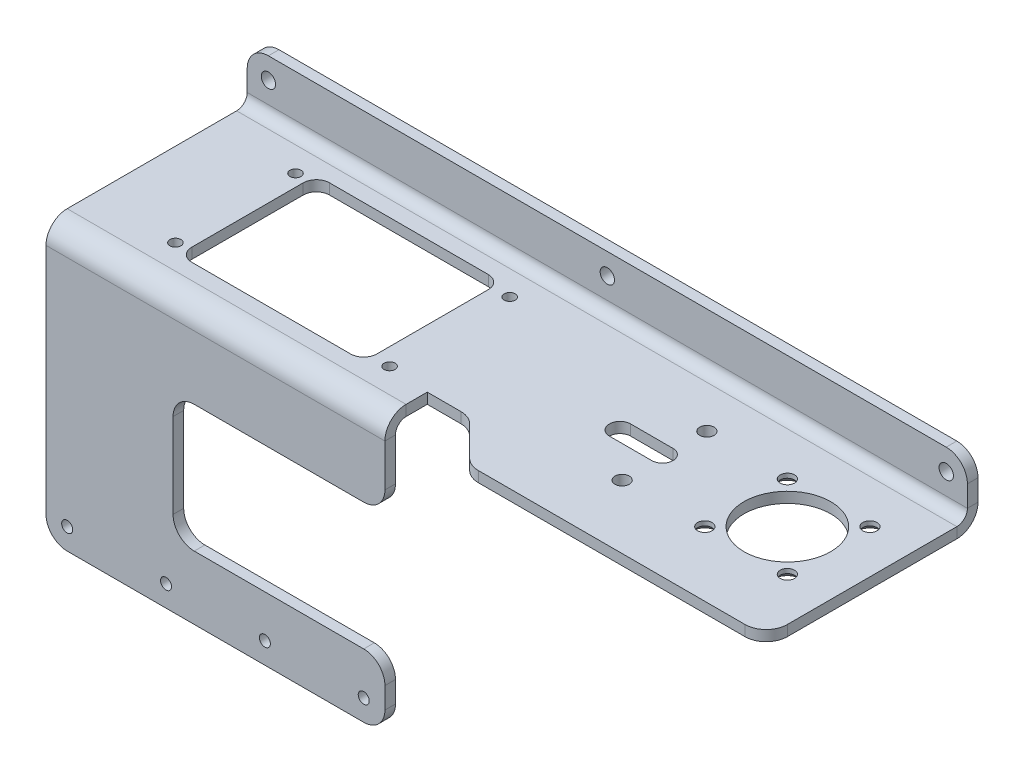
ISO-10303-21;
HEADER;
FILE_DESCRIPTION(('STEP AP214'),'2;1');
FILE_NAME('part.step','',(''),(''),'','','');
FILE_SCHEMA(('AUTOMOTIVE_DESIGN { 1 0 10303 214 1 1 1 1 }'));
ENDSEC;
DATA;
#1=APPLICATION_CONTEXT('core data for automotive mechanical design processes');
#2=APPLICATION_PROTOCOL_DEFINITION('international standard','automotive_design',2000,#1);
#3=PRODUCT_CONTEXT('',#1,'mechanical');
#4=PRODUCT('Part','Part','',(#3));
#5=PRODUCT_RELATED_PRODUCT_CATEGORY('part','',(#4));
#6=PRODUCT_DEFINITION_FORMATION('','',#4);
#7=PRODUCT_DEFINITION_CONTEXT('part definition',#1,'design');
#8=PRODUCT_DEFINITION('design','',#6,#7);
#9=PRODUCT_DEFINITION_SHAPE('','',#8);
#10=(LENGTH_UNIT() NAMED_UNIT(*) SI_UNIT(.MILLI.,.METRE.));
#11=(NAMED_UNIT(*) PLANE_ANGLE_UNIT() SI_UNIT($,.RADIAN.));
#12=(NAMED_UNIT(*) SI_UNIT($,.STERADIAN.) SOLID_ANGLE_UNIT());
#13=UNCERTAINTY_MEASURE_WITH_UNIT(LENGTH_MEASURE(1.E-05),#10,'distance_accuracy_value','');
#14=(GEOMETRIC_REPRESENTATION_CONTEXT(3) GLOBAL_UNCERTAINTY_ASSIGNED_CONTEXT((#13)) GLOBAL_UNIT_ASSIGNED_CONTEXT((#10,
#11,#12)) REPRESENTATION_CONTEXT('',''));
#15=CARTESIAN_POINT('',(0.,0.,0.));
#16=DIRECTION('',(0.,0.,1.));
#17=DIRECTION('',(1.,0.,0.));
#18=AXIS2_PLACEMENT_3D('',#15,#16,#17);
#19=CARTESIAN_POINT('',(101.6,47.625,0.));
#20=DIRECTION('',(0.,0.,-1.));
#21=DIRECTION('',(0.,1.,0.));
#22=AXIS2_PLACEMENT_3D('',#19,#20,#21);
#23=PLANE('',#22);
#24=CARTESIAN_POINT('',(95.25,-28.5750000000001,0.));
#25=DIRECTION('',(0.,0.,1.));
#26=DIRECTION('',(1.,0.,0.));
#27=AXIS2_PLACEMENT_3D('',#24,#25,#26);
#28=CIRCLE('',#27,1.64999999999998);
#29=CARTESIAN_POINT('',(96.9,-28.5750000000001,0.));
#30=VERTEX_POINT('',#29);
#31=EDGE_CURVE('E462',#30,#30,#28,.T.);
#32=ORIENTED_EDGE('',*,*,#31,.F.);
#33=EDGE_LOOP('',(#32));
#34=FACE_BOUND('',#33,.T.);
#35=DIRECTION('',(0.,-1.,0.));
#36=VECTOR('',#35,1.);
#37=CARTESIAN_POINT('',(0.,47.625,0.));
#38=LINE('',#37,#36);
#39=CARTESIAN_POINT('',(0.,41.275,0.));
#40=VERTEX_POINT('',#39);
#41=CARTESIAN_POINT('',(0.,-28.575,0.));
#42=VERTEX_POINT('',#41);
#43=EDGE_CURVE('E625',#40,#42,#38,.T.);
#44=ORIENTED_EDGE('',*,*,#43,.T.);
#45=CARTESIAN_POINT('',(6.35,-28.575,0.));
#46=DIRECTION('',(0.,0.,-1.));
#47=DIRECTION('',(0.,1.,0.));
#48=AXIS2_PLACEMENT_3D('',#45,#46,#47);
#49=CIRCLE('',#48,6.35);
#50=CARTESIAN_POINT('',(6.34999999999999,-34.925,0.));
#51=VERTEX_POINT('',#50);
#52=EDGE_CURVE('E703',#42,#51,#49,.F.);
#53=ORIENTED_EDGE('',*,*,#52,.T.);
#54=DIRECTION('',(-1.,0.,0.));
#55=VECTOR('',#54,1.);
#56=CARTESIAN_POINT('',(101.6,-34.925,0.));
#57=LINE('',#56,#55);
#58=CARTESIAN_POINT('',(95.25,-34.925,0.));
#59=VERTEX_POINT('',#58);
#60=EDGE_CURVE('E681',#59,#51,#57,.T.);
#61=ORIENTED_EDGE('',*,*,#60,.F.);
#62=CARTESIAN_POINT('',(95.25,-28.575,0.));
#63=DIRECTION('',(0.,0.,-1.));
#64=DIRECTION('',(0.,1.,0.));
#65=AXIS2_PLACEMENT_3D('',#62,#63,#64);
#66=CIRCLE('',#65,6.35);
#67=CARTESIAN_POINT('',(101.6,-28.575,0.));
#68=VERTEX_POINT('',#67);
#69=EDGE_CURVE('E701',#59,#68,#66,.F.);
#70=ORIENTED_EDGE('',*,*,#69,.T.);
#71=DIRECTION('',(0.,-1.,0.));
#72=VECTOR('',#71,1.);
#73=CARTESIAN_POINT('',(101.6,47.625,0.));
#74=LINE('',#73,#72);
#75=CARTESIAN_POINT('',(101.6,-22.225,0.));
#76=VERTEX_POINT('',#75);
#77=EDGE_CURVE('E637',#76,#68,#74,.T.);
#78=ORIENTED_EDGE('',*,*,#77,.F.);
#79=CARTESIAN_POINT('',(95.25,-22.225,0.));
#80=DIRECTION('',(0.,0.,-1.));
#81=DIRECTION('',(0.,1.,0.));
#82=AXIS2_PLACEMENT_3D('',#79,#80,#81);
#83=CIRCLE('',#82,6.35);
#84=CARTESIAN_POINT('',(95.25,-15.875,0.));
#85=VERTEX_POINT('',#84);
#86=EDGE_CURVE('E697',#76,#85,#83,.F.);
#87=ORIENTED_EDGE('',*,*,#86,.T.);
#88=DIRECTION('',(1.,0.,0.));
#89=VECTOR('',#88,1.);
#90=CARTESIAN_POINT('',(101.6,-15.875,0.));
#91=LINE('',#90,#89);
#92=CARTESIAN_POINT('',(44.45,-15.875,0.));
#93=VERTEX_POINT('',#92);
#94=EDGE_CURVE('E619',#93,#85,#91,.T.);
#95=ORIENTED_EDGE('',*,*,#94,.F.);
#96=CARTESIAN_POINT('',(44.45,-9.52500000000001,0.));
#97=DIRECTION('',(0.,0.,-1.));
#98=DIRECTION('',(0.,1.,0.));
#99=AXIS2_PLACEMENT_3D('',#96,#97,#98);
#100=CIRCLE('',#99,6.35);
#101=CARTESIAN_POINT('',(38.1,-9.525,0.));
#102=VERTEX_POINT('',#101);
#103=EDGE_CURVE('E785',#93,#102,#100,.T.);
#104=ORIENTED_EDGE('',*,*,#103,.T.);
#105=DIRECTION('',(0.,-1.,0.));
#106=VECTOR('',#105,1.);
#107=CARTESIAN_POINT('',(38.1,22.225,0.));
#108=LINE('',#107,#106);
#109=CARTESIAN_POINT('',(38.1,15.875,0.));
#110=VERTEX_POINT('',#109);
#111=EDGE_CURVE('E628',#110,#102,#108,.T.);
#112=ORIENTED_EDGE('',*,*,#111,.F.);
#113=CARTESIAN_POINT('',(44.45,15.875,0.));
#114=DIRECTION('',(0.,0.,-1.));
#115=DIRECTION('',(0.,1.,0.));
#116=AXIS2_PLACEMENT_3D('',#113,#114,#115);
#117=CIRCLE('',#116,6.35);
#118=CARTESIAN_POINT('',(44.45,22.225,0.));
#119=VERTEX_POINT('',#118);
#120=EDGE_CURVE('E781',#110,#119,#117,.T.);
#121=ORIENTED_EDGE('',*,*,#120,.T.);
#122=DIRECTION('',(-1.,0.,0.));
#123=VECTOR('',#122,1.);
#124=CARTESIAN_POINT('',(101.6,22.225,0.));
#125=LINE('',#124,#123);
#126=CARTESIAN_POINT('',(95.25,22.225,0.));
#127=VERTEX_POINT('',#126);
#128=EDGE_CURVE('E614',#127,#119,#125,.T.);
#129=ORIENTED_EDGE('',*,*,#128,.F.);
#130=CARTESIAN_POINT('',(95.25,28.575,0.));
#131=DIRECTION('',(0.,0.,-1.));
#132=DIRECTION('',(0.,1.,0.));
#133=AXIS2_PLACEMENT_3D('',#130,#131,#132);
#134=CIRCLE('',#133,6.35);
#135=CARTESIAN_POINT('',(101.6,28.575,0.));
#136=VERTEX_POINT('',#135);
#137=EDGE_CURVE('E699',#127,#136,#134,.F.);
#138=ORIENTED_EDGE('',*,*,#137,.T.);
#139=CARTESIAN_POINT('',(101.6,41.275,0.));
#140=VERTEX_POINT('',#139);
#141=EDGE_CURVE('E633',#140,#136,#74,.T.);
#142=ORIENTED_EDGE('',*,*,#141,.F.);
#143=DIRECTION('',(-1.,0.,0.));
#144=VECTOR('',#143,1.);
#145=CARTESIAN_POINT('',(101.6,41.275,0.));
#146=LINE('',#145,#144);
#147=EDGE_CURVE('E651',#140,#40,#146,.T.);
#148=ORIENTED_EDGE('',*,*,#147,.T.);
#149=EDGE_LOOP('',(#44,#53,#61,#70,#78,#87,#95,#104,#112,#121,#129,#138,#142,#148));
#150=FACE_BOUND('',#149,.T.);
#151=CARTESIAN_POINT('',(65.6166666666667,-28.575,0.));
#152=DIRECTION('',(0.,0.,1.));
#153=DIRECTION('',(1.,0.,0.));
#154=AXIS2_PLACEMENT_3D('',#151,#152,#153);
#155=CIRCLE('',#154,1.64999999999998);
#156=CARTESIAN_POINT('',(67.2666666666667,-28.575,0.));
#157=VERTEX_POINT('',#156);
#158=EDGE_CURVE('E456',#157,#157,#155,.T.);
#159=ORIENTED_EDGE('',*,*,#158,.F.);
#160=EDGE_LOOP('',(#159));
#161=FACE_BOUND('',#160,.T.);
#162=CARTESIAN_POINT('',(35.9833333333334,-28.575,0.));
#163=DIRECTION('',(0.,0.,1.));
#164=DIRECTION('',(1.,0.,0.));
#165=AXIS2_PLACEMENT_3D('',#162,#163,#164);
#166=CIRCLE('',#165,1.64999999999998);
#167=CARTESIAN_POINT('',(37.6333333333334,-28.575,0.));
#168=VERTEX_POINT('',#167);
#169=EDGE_CURVE('E450',#168,#168,#166,.T.);
#170=ORIENTED_EDGE('',*,*,#169,.F.);
#171=EDGE_LOOP('',(#170));
#172=FACE_BOUND('',#171,.T.);
#173=CARTESIAN_POINT('',(6.35000000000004,-28.575,0.));
#174=DIRECTION('',(0.,0.,1.));
#175=DIRECTION('',(1.,0.,0.));
#176=AXIS2_PLACEMENT_3D('',#173,#174,#175);
#177=CIRCLE('',#176,1.64999999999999);
#178=CARTESIAN_POINT('',(8.00000000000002,-28.575,0.));
#179=VERTEX_POINT('',#178);
#180=EDGE_CURVE('E430',#179,#179,#177,.T.);
#181=ORIENTED_EDGE('',*,*,#180,.F.);
#182=EDGE_LOOP('',(#181));
#183=FACE_BOUND('',#182,.T.);
#184=ADVANCED_FACE('F60',(#34,#150,#161,#172,#183),#23,.F.);
#185=CARTESIAN_POINT('',(101.6,47.625,-63.5));
#186=DIRECTION('',(0.,-1.,0.));
#187=DIRECTION('',(0.,0.,-1.));
#188=AXIS2_PLACEMENT_3D('',#185,#186,#187);
#189=PLANE('',#188);
#190=DIRECTION('',(-1.,0.,0.));
#191=VECTOR('',#190,1.);
#192=CARTESIAN_POINT('',(153.035,47.625,-34.925));
#193=LINE('',#192,#191);
#194=CARTESIAN_POINT('',(153.035,47.625,-34.925));
#195=VERTEX_POINT('',#194);
#196=CARTESIAN_POINT('',(140.335,47.625,-34.925));
#197=VERTEX_POINT('',#196);
#198=EDGE_CURVE('E346',#195,#197,#193,.T.);
#199=ORIENTED_EDGE('',*,*,#198,.F.);
#200=CARTESIAN_POINT('',(153.035,47.625,-31.75));
#201=DIRECTION('',(0.,1.,0.));
#202=DIRECTION('',(0.,0.,1.));
#203=AXIS2_PLACEMENT_3D('',#200,#201,#202);
#204=CIRCLE('',#203,3.175);
#205=CARTESIAN_POINT('',(153.035,47.625,-28.575));
#206=VERTEX_POINT('',#205);
#207=EDGE_CURVE('E75',#206,#195,#204,.T.);
#208=ORIENTED_EDGE('',*,*,#207,.F.);
#209=DIRECTION('',(1.,0.,0.));
#210=VECTOR('',#209,1.);
#211=CARTESIAN_POINT('',(153.035,47.625,-28.575));
#212=LINE('',#211,#210);
#213=CARTESIAN_POINT('',(140.335,47.625,-28.575));
#214=VERTEX_POINT('',#213);
#215=EDGE_CURVE('E353',#214,#206,#212,.T.);
#216=ORIENTED_EDGE('',*,*,#215,.F.);
#217=CARTESIAN_POINT('',(140.335,47.625,-31.75));
#218=DIRECTION('',(0.,1.,0.));
#219=DIRECTION('',(0.,0.,1.));
#220=AXIS2_PLACEMENT_3D('',#217,#218,#219);
#221=CIRCLE('',#220,3.17499999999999);
#222=EDGE_CURVE('E337',#197,#214,#221,.T.);
#223=ORIENTED_EDGE('',*,*,#222,.F.);
#224=EDGE_LOOP('',(#199,#208,#216,#223));
#225=FACE_BOUND('',#224,.T.);
#226=CARTESIAN_POINT('',(25.05,47.625,-49.7500000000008));
#227=DIRECTION('',(0.,1.,0.));
#228=DIRECTION('',(0.,0.,1.));
#229=AXIS2_PLACEMENT_3D('',#226,#227,#228);
#230=CIRCLE('',#229,1.65);
#231=CARTESIAN_POINT('',(25.05,47.625,-48.1000000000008));
#232=VERTEX_POINT('',#231);
#233=EDGE_CURVE('E360',#232,#232,#230,.T.);
#234=ORIENTED_EDGE('',*,*,#233,.F.);
#235=EDGE_LOOP('',(#234));
#236=FACE_BOUND('',#235,.T.);
#237=CARTESIAN_POINT('',(89.25,47.625,-13.7500000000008));
#238=DIRECTION('',(0.,1.,0.));
#239=DIRECTION('',(0.,0.,1.));
#240=AXIS2_PLACEMENT_3D('',#237,#238,#239);
#241=CIRCLE('',#240,1.65);
#242=CARTESIAN_POINT('',(89.25,47.625,-12.1000000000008));
#243=VERTEX_POINT('',#242);
#244=EDGE_CURVE('E368',#243,#243,#241,.T.);
#245=ORIENTED_EDGE('',*,*,#244,.F.);
#246=EDGE_LOOP('',(#245));
#247=FACE_BOUND('',#246,.T.);
#248=CARTESIAN_POINT('',(89.25,47.625,-49.7500000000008));
#249=DIRECTION('',(0.,1.,0.));
#250=DIRECTION('',(0.,0.,1.));
#251=AXIS2_PLACEMENT_3D('',#248,#249,#250);
#252=CIRCLE('',#251,1.65);
#253=CARTESIAN_POINT('',(89.25,47.625,-48.1000000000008));
#254=VERTEX_POINT('',#253);
#255=EDGE_CURVE('E372',#254,#254,#252,.T.);
#256=ORIENTED_EDGE('',*,*,#255,.F.);
#257=EDGE_LOOP('',(#256));
#258=FACE_BOUND('',#257,.T.);
#259=CARTESIAN_POINT('',(25.05,47.625,-13.7500000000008));
#260=DIRECTION('',(0.,1.,0.));
#261=DIRECTION('',(0.,0.,1.));
#262=AXIS2_PLACEMENT_3D('',#259,#260,#261);
#263=CIRCLE('',#262,1.65);
#264=CARTESIAN_POINT('',(25.05,47.625,-12.1000000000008));
#265=VERTEX_POINT('',#264);
#266=EDGE_CURVE('E376',#265,#265,#263,.T.);
#267=ORIENTED_EDGE('',*,*,#266,.F.);
#268=EDGE_LOOP('',(#267));
#269=FACE_BOUND('',#268,.T.);
#270=DIRECTION('',(0.,0.,1.));
#271=VECTOR('',#270,1.);
#272=CARTESIAN_POINT('',(28.665,47.625,-48.4480000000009));
#273=LINE('',#272,#271);
#274=CARTESIAN_POINT('',(28.665,47.625,-48.4480000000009));
#275=VERTEX_POINT('',#274);
#276=CARTESIAN_POINT('',(28.665,47.625,-15.0520000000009));
#277=VERTEX_POINT('',#276);
#278=EDGE_CURVE('E408',#275,#277,#273,.T.);
#279=ORIENTED_EDGE('',*,*,#278,.F.);
#280=CARTESIAN_POINT('',(32.602,47.625,-48.4480000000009));
#281=DIRECTION('',(0.,1.,0.));
#282=DIRECTION('',(0.,0.,1.));
#283=AXIS2_PLACEMENT_3D('',#280,#281,#282);
#284=CIRCLE('',#283,3.937);
#285=CARTESIAN_POINT('',(32.602,47.625,-52.3850000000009));
#286=VERTEX_POINT('',#285);
#287=EDGE_CURVE('E406',#286,#275,#284,.T.);
#288=ORIENTED_EDGE('',*,*,#287,.F.);
#289=DIRECTION('',(-1.,0.,0.));
#290=VECTOR('',#289,1.);
#291=CARTESIAN_POINT('',(80.198,47.625,-52.3850000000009));
#292=LINE('',#291,#290);
#293=CARTESIAN_POINT('',(80.198,47.625,-52.3850000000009));
#294=VERTEX_POINT('',#293);
#295=EDGE_CURVE('E384',#294,#286,#292,.T.);
#296=ORIENTED_EDGE('',*,*,#295,.F.);
#297=CARTESIAN_POINT('',(80.198,47.625,-48.4480000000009));
#298=DIRECTION('',(0.,1.,0.));
#299=DIRECTION('',(0.,0.,1.));
#300=AXIS2_PLACEMENT_3D('',#297,#298,#299);
#301=CIRCLE('',#300,3.937);
#302=CARTESIAN_POINT('',(84.135,47.625,-48.4480000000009));
#303=VERTEX_POINT('',#302);
#304=EDGE_CURVE('E423',#303,#294,#301,.T.);
#305=ORIENTED_EDGE('',*,*,#304,.F.);
#306=DIRECTION('',(0.,0.,-1.));
#307=VECTOR('',#306,1.);
#308=CARTESIAN_POINT('',(84.135,47.625,-15.0520000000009));
#309=LINE('',#308,#307);
#310=CARTESIAN_POINT('',(84.135,47.625,-15.0520000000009));
#311=VERTEX_POINT('',#310);
#312=EDGE_CURVE('E420',#311,#303,#309,.T.);
#313=ORIENTED_EDGE('',*,*,#312,.F.);
#314=CARTESIAN_POINT('',(80.198,47.625,-15.0520000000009));
#315=DIRECTION('',(0.,1.,0.));
#316=DIRECTION('',(0.,0.,1.));
#317=AXIS2_PLACEMENT_3D('',#314,#315,#316);
#318=CIRCLE('',#317,3.937);
#319=CARTESIAN_POINT('',(80.198,47.625,-11.1150000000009));
#320=VERTEX_POINT('',#319);
#321=EDGE_CURVE('E417',#320,#311,#318,.T.);
#322=ORIENTED_EDGE('',*,*,#321,.F.);
#323=DIRECTION('',(1.,0.,0.));
#324=VECTOR('',#323,1.);
#325=CARTESIAN_POINT('',(32.602,47.625,-11.1150000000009));
#326=LINE('',#325,#324);
#327=CARTESIAN_POINT('',(32.602,47.625,-11.1150000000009));
#328=VERTEX_POINT('',#327);
#329=EDGE_CURVE('E414',#328,#320,#326,.T.);
#330=ORIENTED_EDGE('',*,*,#329,.F.);
#331=CARTESIAN_POINT('',(32.602,47.625,-15.0520000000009));
#332=DIRECTION('',(0.,1.,0.));
#333=DIRECTION('',(0.,0.,1.));
#334=AXIS2_PLACEMENT_3D('',#331,#332,#333);
#335=CIRCLE('',#334,3.937);
#336=EDGE_CURVE('E411',#277,#328,#335,.T.);
#337=ORIENTED_EDGE('',*,*,#336,.F.);
#338=EDGE_LOOP('',(#279,#288,#296,#305,#313,#322,#330,#337));
#339=FACE_BOUND('',#338,.T.);
#340=CARTESIAN_POINT('',(202.874368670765,47.625,-19.3756313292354));
#341=DIRECTION('',(0.,-1.,0.));
#342=DIRECTION('',(-1.,0.,0.));
#343=AXIS2_PLACEMENT_3D('',#340,#341,#342);
#344=CIRCLE('',#343,2.14999999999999);
#345=CARTESIAN_POINT('',(200.724368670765,47.625,-19.3756313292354));
#346=VERTEX_POINT('',#345);
#347=EDGE_CURVE('E472',#346,#346,#344,.T.);
#348=ORIENTED_EDGE('',*,*,#347,.T.);
#349=EDGE_LOOP('',(#348));
#350=FACE_BOUND('',#349,.T.);
#351=CARTESIAN_POINT('',(202.874368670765,47.625,-44.1243686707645));
#352=DIRECTION('',(0.,-1.,0.));
#353=DIRECTION('',(0.,0.,1.));
#354=AXIS2_PLACEMENT_3D('',#351,#352,#353);
#355=CIRCLE('',#354,2.14999999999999);
#356=CARTESIAN_POINT('',(202.874368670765,47.625,-41.9743686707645));
#357=VERTEX_POINT('',#356);
#358=EDGE_CURVE('E483',#357,#357,#355,.T.);
#359=ORIENTED_EDGE('',*,*,#358,.T.);
#360=EDGE_LOOP('',(#359));
#361=FACE_BOUND('',#360,.T.);
#362=CARTESIAN_POINT('',(178.125631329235,47.625,-44.1243686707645));
#363=DIRECTION('',(0.,-1.,0.));
#364=DIRECTION('',(1.,0.,0.));
#365=AXIS2_PLACEMENT_3D('',#362,#363,#364);
#366=CIRCLE('',#365,2.14999999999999);
#367=CARTESIAN_POINT('',(180.275631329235,47.625,-44.1243686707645));
#368=VERTEX_POINT('',#367);
#369=EDGE_CURVE('E491',#368,#368,#366,.T.);
#370=ORIENTED_EDGE('',*,*,#369,.T.);
#371=EDGE_LOOP('',(#370));
#372=FACE_BOUND('',#371,.T.);
#373=CARTESIAN_POINT('',(178.125631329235,47.625,-19.3756313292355));
#374=DIRECTION('',(0.,-1.,0.));
#375=DIRECTION('',(0.,0.,-1.));
#376=AXIS2_PLACEMENT_3D('',#373,#374,#375);
#377=CIRCLE('',#376,2.14999999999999);
#378=CARTESIAN_POINT('',(178.125631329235,47.625,-21.5256313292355));
#379=VERTEX_POINT('',#378);
#380=EDGE_CURVE('E501',#379,#379,#377,.T.);
#381=ORIENTED_EDGE('',*,*,#380,.T.);
#382=EDGE_LOOP('',(#381));
#383=FACE_BOUND('',#382,.T.);
#384=CARTESIAN_POINT('',(153.67,47.625,-44.45));
#385=DIRECTION('',(0.,1.,0.));
#386=DIRECTION('',(0.,0.,1.));
#387=AXIS2_PLACEMENT_3D('',#384,#385,#386);
#388=CIRCLE('',#387,2.15000000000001);
#389=CARTESIAN_POINT('',(153.67,47.625,-42.3));
#390=VERTEX_POINT('',#389);
#391=EDGE_CURVE('E508',#390,#390,#388,.T.);
#392=ORIENTED_EDGE('',*,*,#391,.F.);
#393=EDGE_LOOP('',(#392));
#394=FACE_BOUND('',#393,.T.);
#395=CARTESIAN_POINT('',(190.5,47.625,-31.75));
#396=DIRECTION('',(0.,1.,0.));
#397=DIRECTION('',(0.,0.,1.));
#398=AXIS2_PLACEMENT_3D('',#395,#396,#397);
#399=CIRCLE('',#398,13.);
#400=CARTESIAN_POINT('',(190.5,47.625,-18.75));
#401=VERTEX_POINT('',#400);
#402=EDGE_CURVE('E533',#401,#401,#399,.T.);
#403=ORIENTED_EDGE('',*,*,#402,.F.);
#404=EDGE_LOOP('',(#403));
#405=FACE_BOUND('',#404,.T.);
#406=DIRECTION('',(0.707106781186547,0.,0.707106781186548));
#407=VECTOR('',#406,1.);
#408=CARTESIAN_POINT('',(114.3,47.625,-12.7));
#409=LINE('',#408,#407);
#410=CARTESIAN_POINT('',(116.159871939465,47.625,-10.8401280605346));
#411=VERTEX_POINT('',#410);
#412=CARTESIAN_POINT('',(125.140128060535,47.625,-1.85987193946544));
#413=VERTEX_POINT('',#412);
#414=EDGE_CURVE('E605',#411,#413,#409,.T.);
#415=ORIENTED_EDGE('',*,*,#414,.T.);
#416=CARTESIAN_POINT('',(129.630256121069,47.625,-6.35));
#417=DIRECTION('',(0.,-1.,0.));
#418=DIRECTION('',(0.,0.,-1.));
#419=AXIS2_PLACEMENT_3D('',#416,#417,#418);
#420=CIRCLE('',#419,6.35);
#421=CARTESIAN_POINT('',(129.630256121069,47.625,0.));
#422=VERTEX_POINT('',#421);
#423=EDGE_CURVE('E745',#413,#422,#420,.F.);
#424=ORIENTED_EDGE('',*,*,#423,.T.);
#425=DIRECTION('',(1.,0.,0.));
#426=VECTOR('',#425,1.);
#427=CARTESIAN_POINT('',(127.,47.625,0.));
#428=LINE('',#427,#426);
#429=CARTESIAN_POINT('',(209.55,47.625,0.));
#430=VERTEX_POINT('',#429);
#431=EDGE_CURVE('E608',#422,#430,#428,.T.);
#432=ORIENTED_EDGE('',*,*,#431,.T.);
#433=CARTESIAN_POINT('',(209.55,47.625,-6.35));
#434=DIRECTION('',(0.,-1.,0.));
#435=DIRECTION('',(0.,0.,-1.));
#436=AXIS2_PLACEMENT_3D('',#433,#434,#435);
#437=CIRCLE('',#436,6.35);
#438=CARTESIAN_POINT('',(215.9,47.625,-6.35));
#439=VERTEX_POINT('',#438);
#440=EDGE_CURVE('E743',#430,#439,#437,.F.);
#441=ORIENTED_EDGE('',*,*,#440,.T.);
#442=DIRECTION('',(0.,0.,-1.));
#443=VECTOR('',#442,1.);
#444=CARTESIAN_POINT('',(215.9,47.625,-63.5));
#445=LINE('',#444,#443);
#446=CARTESIAN_POINT('',(215.9,47.625,-57.15));
#447=VERTEX_POINT('',#446);
#448=EDGE_CURVE('E594',#439,#447,#445,.T.);
#449=ORIENTED_EDGE('',*,*,#448,.T.);
#450=DIRECTION('',(-1.,0.,0.));
#451=VECTOR('',#450,1.);
#452=CARTESIAN_POINT('',(0.,47.625,-57.15));
#453=LINE('',#452,#451);
#454=CARTESIAN_POINT('',(0.,47.625,-57.15));
#455=VERTEX_POINT('',#454);
#456=EDGE_CURVE('E579',#455,#447,#453,.F.);
#457=ORIENTED_EDGE('',*,*,#456,.F.);
#458=DIRECTION('',(0.,0.,1.));
#459=VECTOR('',#458,1.);
#460=CARTESIAN_POINT('',(0.,47.625,-63.5));
#461=LINE('',#460,#459);
#462=CARTESIAN_POINT('',(0.,47.625,-6.35));
#463=VERTEX_POINT('',#462);
#464=EDGE_CURVE('E662',#455,#463,#461,.T.);
#465=ORIENTED_EDGE('',*,*,#464,.T.);
#466=DIRECTION('',(-1.,0.,0.));
#467=VECTOR('',#466,1.);
#468=CARTESIAN_POINT('',(101.6,47.625,-6.35));
#469=LINE('',#468,#467);
#470=CARTESIAN_POINT('',(101.6,47.625,-6.35));
#471=VERTEX_POINT('',#470);
#472=EDGE_CURVE('E669',#471,#463,#469,.T.);
#473=ORIENTED_EDGE('',*,*,#472,.F.);
#474=DIRECTION('',(0.,0.,1.));
#475=VECTOR('',#474,1.);
#476=CARTESIAN_POINT('',(101.6,47.625,-63.5));
#477=LINE('',#476,#475);
#478=CARTESIAN_POINT('',(101.6,47.625,-12.7));
#479=VERTEX_POINT('',#478);
#480=EDGE_CURVE('E646',#479,#471,#477,.T.);
#481=ORIENTED_EDGE('',*,*,#480,.F.);
#482=DIRECTION('',(1.,0.,0.));
#483=VECTOR('',#482,1.);
#484=CARTESIAN_POINT('',(101.6,47.625,-12.7));
#485=LINE('',#484,#483);
#486=CARTESIAN_POINT('',(111.669743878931,47.625,-12.7));
#487=VERTEX_POINT('',#486);
#488=EDGE_CURVE('E587',#479,#487,#485,.T.);
#489=ORIENTED_EDGE('',*,*,#488,.T.);
#490=CARTESIAN_POINT('',(111.669743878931,47.625,-6.35));
#491=DIRECTION('',(0.,-1.,0.));
#492=DIRECTION('',(0.,0.,-1.));
#493=AXIS2_PLACEMENT_3D('',#490,#491,#492);
#494=CIRCLE('',#493,6.35);
#495=EDGE_CURVE('E789',#487,#411,#494,.T.);
#496=ORIENTED_EDGE('',*,*,#495,.T.);
#497=EDGE_LOOP('',(#415,#424,#432,#441,#449,#457,#465,#473,#481,#489,#496));
#498=FACE_BOUND('',#497,.T.);
#499=CARTESIAN_POINT('',(153.67,47.625,-19.05));
#500=DIRECTION('',(0.,1.,0.));
#501=DIRECTION('',(0.,0.,1.));
#502=AXIS2_PLACEMENT_3D('',#499,#500,#501);
#503=CIRCLE('',#502,2.15000000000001);
#504=CARTESIAN_POINT('',(153.67,47.625,-16.9));
#505=VERTEX_POINT('',#504);
#506=EDGE_CURVE('E502',#505,#505,#503,.T.);
#507=ORIENTED_EDGE('',*,*,#506,.F.);
#508=EDGE_LOOP('',(#507));
#509=FACE_BOUND('',#508,.T.);
#510=ADVANCED_FACE('F350',(#225,#236,#247,#258,#269,#339,#350,#361,#372,#383,#394,#405,#498,
#509),#189,.F.);
#511=CARTESIAN_POINT('',(101.6,44.45,-63.5));
#512=DIRECTION('',(0.,-1.,0.));
#513=DIRECTION('',(0.,0.,-1.));
#514=AXIS2_PLACEMENT_3D('',#511,#512,#513);
#515=PLANE('',#514);
#516=CARTESIAN_POINT('',(153.035,44.45,-31.75));
#517=DIRECTION('',(0.,-1.,0.));
#518=DIRECTION('',(0.,0.,-1.));
#519=AXIS2_PLACEMENT_3D('',#516,#517,#518);
#520=CIRCLE('',#519,3.175);
#521=CARTESIAN_POINT('',(153.035,44.45,-34.925));
#522=VERTEX_POINT('',#521);
#523=CARTESIAN_POINT('',(153.035,44.45,-28.575));
#524=VERTEX_POINT('',#523);
#525=EDGE_CURVE('E13',#522,#524,#520,.T.);
#526=ORIENTED_EDGE('',*,*,#525,.F.);
#527=DIRECTION('',(1.,0.,0.));
#528=VECTOR('',#527,1.);
#529=CARTESIAN_POINT('',(101.6,44.45,-34.9249999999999));
#530=LINE('',#529,#528);
#531=CARTESIAN_POINT('',(140.335,44.45,-34.925));
#532=VERTEX_POINT('',#531);
#533=EDGE_CURVE('E793',#532,#522,#530,.T.);
#534=ORIENTED_EDGE('',*,*,#533,.F.);
#535=CARTESIAN_POINT('',(140.335,44.45,-31.75));
#536=DIRECTION('',(0.,-1.,0.));
#537=DIRECTION('',(0.,0.,-1.));
#538=AXIS2_PLACEMENT_3D('',#535,#536,#537);
#539=CIRCLE('',#538,3.17499999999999);
#540=CARTESIAN_POINT('',(140.335,44.45,-28.575));
#541=VERTEX_POINT('',#540);
#542=EDGE_CURVE('E340',#541,#532,#539,.T.);
#543=ORIENTED_EDGE('',*,*,#542,.F.);
#544=DIRECTION('',(-1.,0.,0.));
#545=VECTOR('',#544,1.);
#546=CARTESIAN_POINT('',(101.6,44.45,-28.575));
#547=LINE('',#546,#545);
#548=EDGE_CURVE('E68',#524,#541,#547,.T.);
#549=ORIENTED_EDGE('',*,*,#548,.F.);
#550=EDGE_LOOP('',(#526,#534,#543,#549));
#551=FACE_BOUND('',#550,.T.);
#552=CARTESIAN_POINT('',(25.05,44.45,-49.7500000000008));
#553=DIRECTION('',(0.,-1.,0.));
#554=DIRECTION('',(0.,0.,-1.));
#555=AXIS2_PLACEMENT_3D('',#552,#553,#554);
#556=CIRCLE('',#555,1.64999999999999);
#557=CARTESIAN_POINT('',(25.05,44.45,-51.4000000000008));
#558=VERTEX_POINT('',#557);
#559=EDGE_CURVE('E365',#558,#558,#556,.T.);
#560=ORIENTED_EDGE('',*,*,#559,.F.);
#561=EDGE_LOOP('',(#560));
#562=FACE_BOUND('',#561,.T.);
#563=CARTESIAN_POINT('',(89.25,44.45,-13.7500000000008));
#564=DIRECTION('',(0.,-1.,0.));
#565=DIRECTION('',(0.,0.,-1.));
#566=AXIS2_PLACEMENT_3D('',#563,#564,#565);
#567=CIRCLE('',#566,1.64999999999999);
#568=CARTESIAN_POINT('',(89.25,44.45,-15.4000000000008));
#569=VERTEX_POINT('',#568);
#570=EDGE_CURVE('E371',#569,#569,#567,.T.);
#571=ORIENTED_EDGE('',*,*,#570,.F.);
#572=EDGE_LOOP('',(#571));
#573=FACE_BOUND('',#572,.T.);
#574=CARTESIAN_POINT('',(89.25,44.45,-49.7500000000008));
#575=DIRECTION('',(0.,-1.,0.));
#576=DIRECTION('',(0.,0.,-1.));
#577=AXIS2_PLACEMENT_3D('',#574,#575,#576);
#578=CIRCLE('',#577,1.64999999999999);
#579=CARTESIAN_POINT('',(89.25,44.45,-51.4000000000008));
#580=VERTEX_POINT('',#579);
#581=EDGE_CURVE('E375',#580,#580,#578,.T.);
#582=ORIENTED_EDGE('',*,*,#581,.F.);
#583=EDGE_LOOP('',(#582));
#584=FACE_BOUND('',#583,.T.);
#585=CARTESIAN_POINT('',(25.05,44.45,-13.7500000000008));
#586=DIRECTION('',(0.,-1.,0.));
#587=DIRECTION('',(0.,0.,-1.));
#588=AXIS2_PLACEMENT_3D('',#585,#586,#587);
#589=CIRCLE('',#588,1.64999999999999);
#590=CARTESIAN_POINT('',(25.05,44.45,-15.4000000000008));
#591=VERTEX_POINT('',#590);
#592=EDGE_CURVE('E379',#591,#591,#589,.T.);
#593=ORIENTED_EDGE('',*,*,#592,.F.);
#594=EDGE_LOOP('',(#593));
#595=FACE_BOUND('',#594,.T.);
#596=CARTESIAN_POINT('',(32.602,44.45,-48.4480000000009));
#597=DIRECTION('',(0.,1.,0.));
#598=DIRECTION('',(0.,0.,1.));
#599=AXIS2_PLACEMENT_3D('',#596,#597,#598);
#600=CIRCLE('',#599,3.937);
#601=CARTESIAN_POINT('',(32.602,44.45,-52.3850000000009));
#602=VERTEX_POINT('',#601);
#603=CARTESIAN_POINT('',(28.665,44.45,-48.4480000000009));
#604=VERTEX_POINT('',#603);
#605=EDGE_CURVE('E380',#602,#604,#600,.T.);
#606=ORIENTED_EDGE('',*,*,#605,.T.);
#607=DIRECTION('',(0.,0.,1.));
#608=VECTOR('',#607,1.);
#609=CARTESIAN_POINT('',(28.665,44.45,-48.4480000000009));
#610=LINE('',#609,#608);
#611=CARTESIAN_POINT('',(28.665,44.45,-15.0520000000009));
#612=VERTEX_POINT('',#611);
#613=EDGE_CURVE('E383',#604,#612,#610,.T.);
#614=ORIENTED_EDGE('',*,*,#613,.T.);
#615=CARTESIAN_POINT('',(32.602,44.45,-15.0520000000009));
#616=DIRECTION('',(0.,1.,0.));
#617=DIRECTION('',(0.,0.,1.));
#618=AXIS2_PLACEMENT_3D('',#615,#616,#617);
#619=CIRCLE('',#618,3.937);
#620=CARTESIAN_POINT('',(32.602,44.45,-11.1150000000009));
#621=VERTEX_POINT('',#620);
#622=EDGE_CURVE('E387',#612,#621,#619,.T.);
#623=ORIENTED_EDGE('',*,*,#622,.T.);
#624=DIRECTION('',(1.,0.,0.));
#625=VECTOR('',#624,1.);
#626=CARTESIAN_POINT('',(32.602,44.45,-11.1150000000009));
#627=LINE('',#626,#625);
#628=CARTESIAN_POINT('',(80.198,44.45,-11.1150000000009));
#629=VERTEX_POINT('',#628);
#630=EDGE_CURVE('E390',#621,#629,#627,.T.);
#631=ORIENTED_EDGE('',*,*,#630,.T.);
#632=CARTESIAN_POINT('',(80.198,44.45,-15.0520000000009));
#633=DIRECTION('',(0.,1.,0.));
#634=DIRECTION('',(0.,0.,1.));
#635=AXIS2_PLACEMENT_3D('',#632,#633,#634);
#636=CIRCLE('',#635,3.937);
#637=CARTESIAN_POINT('',(84.135,44.45,-15.0520000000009));
#638=VERTEX_POINT('',#637);
#639=EDGE_CURVE('E393',#629,#638,#636,.T.);
#640=ORIENTED_EDGE('',*,*,#639,.T.);
#641=DIRECTION('',(0.,0.,-1.));
#642=VECTOR('',#641,1.);
#643=CARTESIAN_POINT('',(84.135,44.45,-15.0520000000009));
#644=LINE('',#643,#642);
#645=CARTESIAN_POINT('',(84.135,44.45,-48.4480000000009));
#646=VERTEX_POINT('',#645);
#647=EDGE_CURVE('E396',#638,#646,#644,.T.);
#648=ORIENTED_EDGE('',*,*,#647,.T.);
#649=CARTESIAN_POINT('',(80.198,44.45,-48.4480000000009));
#650=DIRECTION('',(0.,1.,0.));
#651=DIRECTION('',(0.,0.,1.));
#652=AXIS2_PLACEMENT_3D('',#649,#650,#651);
#653=CIRCLE('',#652,3.937);
#654=CARTESIAN_POINT('',(80.198,44.45,-52.3850000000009));
#655=VERTEX_POINT('',#654);
#656=EDGE_CURVE('E399',#646,#655,#653,.T.);
#657=ORIENTED_EDGE('',*,*,#656,.T.);
#658=DIRECTION('',(-1.,0.,0.));
#659=VECTOR('',#658,1.);
#660=CARTESIAN_POINT('',(80.198,44.45,-52.3850000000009));
#661=LINE('',#660,#659);
#662=EDGE_CURVE('E402',#655,#602,#661,.T.);
#663=ORIENTED_EDGE('',*,*,#662,.T.);
#664=EDGE_LOOP('',(#606,#614,#623,#631,#640,#648,#657,#663));
#665=FACE_BOUND('',#664,.T.);
#666=CARTESIAN_POINT('',(202.874368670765,44.45,-19.3756313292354));
#667=DIRECTION('',(0.,-1.,0.));
#668=DIRECTION('',(-1.,0.,0.));
#669=AXIS2_PLACEMENT_3D('',#666,#667,#668);
#670=CIRCLE('',#669,4.);
#671=CARTESIAN_POINT('',(198.874368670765,44.45,-19.3756313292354));
#672=VERTEX_POINT('',#671);
#673=EDGE_CURVE('E469',#672,#672,#670,.T.);
#674=ORIENTED_EDGE('',*,*,#673,.F.);
#675=EDGE_LOOP('',(#674));
#676=FACE_BOUND('',#675,.T.);
#677=CARTESIAN_POINT('',(202.874368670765,44.45,-44.1243686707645));
#678=DIRECTION('',(0.,-1.,0.));
#679=DIRECTION('',(0.,0.,1.));
#680=AXIS2_PLACEMENT_3D('',#677,#678,#679);
#681=CIRCLE('',#680,4.);
#682=CARTESIAN_POINT('',(202.874368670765,44.45,-40.1243686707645));
#683=VERTEX_POINT('',#682);
#684=EDGE_CURVE('E480',#683,#683,#681,.T.);
#685=ORIENTED_EDGE('',*,*,#684,.F.);
#686=EDGE_LOOP('',(#685));
#687=FACE_BOUND('',#686,.T.);
#688=CARTESIAN_POINT('',(178.125631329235,44.45,-44.1243686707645));
#689=DIRECTION('',(0.,-1.,0.));
#690=DIRECTION('',(1.,0.,0.));
#691=AXIS2_PLACEMENT_3D('',#688,#689,#690);
#692=CIRCLE('',#691,4.);
#693=CARTESIAN_POINT('',(182.125631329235,44.45,-44.1243686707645));
#694=VERTEX_POINT('',#693);
#695=EDGE_CURVE('E468',#694,#694,#692,.T.);
#696=ORIENTED_EDGE('',*,*,#695,.F.);
#697=EDGE_LOOP('',(#696));
#698=FACE_BOUND('',#697,.T.);
#699=CARTESIAN_POINT('',(178.125631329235,44.45,-19.3756313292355));
#700=DIRECTION('',(0.,-1.,0.));
#701=DIRECTION('',(0.,0.,-1.));
#702=AXIS2_PLACEMENT_3D('',#699,#700,#701);
#703=CIRCLE('',#702,4.);
#704=CARTESIAN_POINT('',(178.125631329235,44.45,-23.3756313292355));
#705=VERTEX_POINT('',#704);
#706=EDGE_CURVE('E479',#705,#705,#703,.T.);
#707=ORIENTED_EDGE('',*,*,#706,.F.);
#708=EDGE_LOOP('',(#707));
#709=FACE_BOUND('',#708,.T.);
#710=CARTESIAN_POINT('',(153.67,44.45,-19.05));
#711=DIRECTION('',(0.,-1.,0.));
#712=DIRECTION('',(0.,0.,-1.));
#713=AXIS2_PLACEMENT_3D('',#710,#711,#712);
#714=CIRCLE('',#713,2.15);
#715=CARTESIAN_POINT('',(153.67,44.45,-21.2));
#716=VERTEX_POINT('',#715);
#717=EDGE_CURVE('E505',#716,#716,#714,.T.);
#718=ORIENTED_EDGE('',*,*,#717,.F.);
#719=EDGE_LOOP('',(#718));
#720=FACE_BOUND('',#719,.T.);
#721=CARTESIAN_POINT('',(153.67,44.45,-44.45));
#722=DIRECTION('',(0.,-1.,0.));
#723=DIRECTION('',(0.,0.,-1.));
#724=AXIS2_PLACEMENT_3D('',#721,#722,#723);
#725=CIRCLE('',#724,2.15);
#726=CARTESIAN_POINT('',(153.67,44.45,-46.6));
#727=VERTEX_POINT('',#726);
#728=EDGE_CURVE('E511',#727,#727,#725,.T.);
#729=ORIENTED_EDGE('',*,*,#728,.F.);
#730=EDGE_LOOP('',(#729));
#731=FACE_BOUND('',#730,.T.);
#732=CARTESIAN_POINT('',(190.5,44.45,-31.75));
#733=DIRECTION('',(0.,1.,0.));
#734=DIRECTION('',(0.,0.,1.));
#735=AXIS2_PLACEMENT_3D('',#732,#733,#734);
#736=CIRCLE('',#735,13.);
#737=CARTESIAN_POINT('',(190.5,44.45,-18.75));
#738=VERTEX_POINT('',#737);
#739=EDGE_CURVE('E532',#738,#738,#736,.T.);
#740=ORIENTED_EDGE('',*,*,#739,.T.);
#741=EDGE_LOOP('',(#740));
#742=FACE_BOUND('',#741,.T.);
#743=DIRECTION('',(1.,0.,0.));
#744=VECTOR('',#743,1.);
#745=CARTESIAN_POINT('',(127.,44.45,0.));
#746=LINE('',#745,#744);
#747=CARTESIAN_POINT('',(129.630256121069,44.45,0.));
#748=VERTEX_POINT('',#747);
#749=CARTESIAN_POINT('',(209.55,44.45,0.));
#750=VERTEX_POINT('',#749);
#751=EDGE_CURVE('E597',#748,#750,#746,.T.);
#752=ORIENTED_EDGE('',*,*,#751,.F.);
#753=CARTESIAN_POINT('',(129.630256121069,44.45,-6.35));
#754=DIRECTION('',(0.,-1.,0.));
#755=DIRECTION('',(0.,0.,-1.));
#756=AXIS2_PLACEMENT_3D('',#753,#754,#755);
#757=CIRCLE('',#756,6.35);
#758=CARTESIAN_POINT('',(125.140128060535,44.45,-1.85987193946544));
#759=VERTEX_POINT('',#758);
#760=EDGE_CURVE('E754',#748,#759,#757,.T.);
#761=ORIENTED_EDGE('',*,*,#760,.T.);
#762=DIRECTION('',(0.707106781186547,0.,0.707106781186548));
#763=VECTOR('',#762,1.);
#764=CARTESIAN_POINT('',(114.3,44.45,-12.7));
#765=LINE('',#764,#763);
#766=CARTESIAN_POINT('',(116.159871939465,44.45,-10.8401280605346));
#767=VERTEX_POINT('',#766);
#768=EDGE_CURVE('E593',#767,#759,#765,.T.);
#769=ORIENTED_EDGE('',*,*,#768,.F.);
#770=CARTESIAN_POINT('',(111.669743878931,44.45,-6.35));
#771=DIRECTION('',(0.,-1.,0.));
#772=DIRECTION('',(0.,0.,-1.));
#773=AXIS2_PLACEMENT_3D('',#770,#771,#772);
#774=CIRCLE('',#773,6.35);
#775=CARTESIAN_POINT('',(111.669743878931,44.45,-12.7));
#776=VERTEX_POINT('',#775);
#777=EDGE_CURVE('E791',#767,#776,#774,.F.);
#778=ORIENTED_EDGE('',*,*,#777,.T.);
#779=DIRECTION('',(1.,0.,0.));
#780=VECTOR('',#779,1.);
#781=CARTESIAN_POINT('',(101.6,44.45,-12.7));
#782=LINE('',#781,#780);
#783=CARTESIAN_POINT('',(101.6,44.45,-12.7));
#784=VERTEX_POINT('',#783);
#785=EDGE_CURVE('E590',#784,#776,#782,.T.);
#786=ORIENTED_EDGE('',*,*,#785,.F.);
#787=DIRECTION('',(0.,0.,1.));
#788=VECTOR('',#787,1.);
#789=CARTESIAN_POINT('',(101.6,44.45,-63.5));
#790=LINE('',#789,#788);
#791=CARTESIAN_POINT('',(101.6,44.45,-6.35));
#792=VERTEX_POINT('',#791);
#793=EDGE_CURVE('E644',#784,#792,#790,.T.);
#794=ORIENTED_EDGE('',*,*,#793,.T.);
#795=DIRECTION('',(-1.,0.,0.));
#796=VECTOR('',#795,1.);
#797=CARTESIAN_POINT('',(101.6,44.45,-6.35));
#798=LINE('',#797,#796);
#799=CARTESIAN_POINT('',(0.,44.45,-6.35));
#800=VERTEX_POINT('',#799);
#801=EDGE_CURVE('E672',#792,#800,#798,.T.);
#802=ORIENTED_EDGE('',*,*,#801,.T.);
#803=DIRECTION('',(0.,0.,1.));
#804=VECTOR('',#803,1.);
#805=CARTESIAN_POINT('',(0.,44.45,-63.5));
#806=LINE('',#805,#804);
#807=CARTESIAN_POINT('',(0.,44.45,-57.15));
#808=VERTEX_POINT('',#807);
#809=EDGE_CURVE('E660',#808,#800,#806,.T.);
#810=ORIENTED_EDGE('',*,*,#809,.F.);
#811=DIRECTION('',(-1.,0.,0.));
#812=VECTOR('',#811,1.);
#813=CARTESIAN_POINT('',(0.,44.45,-57.15));
#814=LINE('',#813,#812);
#815=CARTESIAN_POINT('',(215.9,44.45,-57.15));
#816=VERTEX_POINT('',#815);
#817=EDGE_CURVE('E566',#808,#816,#814,.F.);
#818=ORIENTED_EDGE('',*,*,#817,.T.);
#819=DIRECTION('',(0.,0.,-1.));
#820=VECTOR('',#819,1.);
#821=CARTESIAN_POINT('',(215.9,44.45,-63.5));
#822=LINE('',#821,#820);
#823=CARTESIAN_POINT('',(215.9,44.45,-6.35));
#824=VERTEX_POINT('',#823);
#825=EDGE_CURVE('E600',#824,#816,#822,.T.);
#826=ORIENTED_EDGE('',*,*,#825,.F.);
#827=CARTESIAN_POINT('',(209.55,44.45,-6.35));
#828=DIRECTION('',(0.,-1.,0.));
#829=DIRECTION('',(0.,0.,-1.));
#830=AXIS2_PLACEMENT_3D('',#827,#828,#829);
#831=CIRCLE('',#830,6.35);
#832=EDGE_CURVE('E752',#824,#750,#831,.T.);
#833=ORIENTED_EDGE('',*,*,#832,.T.);
#834=EDGE_LOOP('',(#752,#761,#769,#778,#786,#794,#802,#810,#818,#826,#833));
#835=FACE_BOUND('',#834,.T.);
#836=ADVANCED_FACE('F809',(#551,#562,#573,#584,#595,#665,#676,#687,#698,#709,#720,#731,#742,
#835),#515,.T.);
#837=CARTESIAN_POINT('',(0.,41.275,-6.35));
#838=DIRECTION('',(1.,0.,0.));
#839=DIRECTION('',(0.,0.,-1.));
#840=AXIS2_PLACEMENT_3D('',#837,#838,#839);
#841=PLANE('',#840);
#842=DIRECTION('',(0.,-1.,0.));
#843=VECTOR('',#842,1.);
#844=CARTESIAN_POINT('',(0.,47.625,-57.15));
#845=LINE('',#844,#843);
#846=EDGE_CURVE('E573',#455,#808,#845,.T.);
#847=ORIENTED_EDGE('',*,*,#846,.T.);
#848=ORIENTED_EDGE('',*,*,#809,.T.);
#849=DIRECTION('',(0.,1.,0.));
#850=VECTOR('',#849,1.);
#851=CARTESIAN_POINT('',(0.,44.45,-6.35));
#852=LINE('',#851,#850);
#853=EDGE_CURVE('E684',#800,#463,#852,.T.);
#854=ORIENTED_EDGE('',*,*,#853,.T.);
#855=ORIENTED_EDGE('',*,*,#464,.F.);
#856=EDGE_LOOP('',(#847,#848,#854,#855));
#857=FACE_BOUND('',#856,.T.);
#858=ADVANCED_FACE('F992',(#857),#841,.F.);
#859=CARTESIAN_POINT('',(101.6,41.275,-6.35));
#860=DIRECTION('',(1.,0.,0.));
#861=DIRECTION('',(0.,0.,-1.));
#862=AXIS2_PLACEMENT_3D('',#859,#860,#861);
#863=PLANE('',#862);
#864=ORIENTED_EDGE('',*,*,#77,.T.);
#865=DIRECTION('',(0.,0.,1.));
#866=VECTOR('',#865,1.);
#867=CARTESIAN_POINT('',(101.6,-28.575,-6.35));
#868=LINE('',#867,#866);
#869=CARTESIAN_POINT('',(101.6,-28.575,-3.17500000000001));
#870=VERTEX_POINT('',#869);
#871=EDGE_CURVE('E721',#68,#870,#868,.F.);
#872=ORIENTED_EDGE('',*,*,#871,.T.);
#873=DIRECTION('',(0.,-1.,0.));
#874=VECTOR('',#873,1.);
#875=CARTESIAN_POINT('',(101.6,47.625,-3.175));
#876=LINE('',#875,#874);
#877=CARTESIAN_POINT('',(101.6,-22.225,-3.17500000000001));
#878=VERTEX_POINT('',#877);
#879=EDGE_CURVE('E636',#878,#870,#876,.T.);
#880=ORIENTED_EDGE('',*,*,#879,.F.);
#881=DIRECTION('',(0.,0.,1.));
#882=VECTOR('',#881,1.);
#883=CARTESIAN_POINT('',(101.6,-22.225,0.));
#884=LINE('',#883,#882);
#885=EDGE_CURVE('E718',#878,#76,#884,.T.);
#886=ORIENTED_EDGE('',*,*,#885,.T.);
#887=EDGE_LOOP('',(#864,#872,#880,#886));
#888=FACE_BOUND('',#887,.T.);
#889=ADVANCED_FACE('F852',(#888),#863,.T.);
#890=CARTESIAN_POINT('',(101.6,47.625,-6.35));
#891=DIRECTION('',(1.,0.,0.));
#892=DIRECTION('',(0.,0.,-1.));
#893=AXIS2_PLACEMENT_3D('',#890,#891,#892);
#894=PLANE('',#893);
#895=DIRECTION('',(0.,-1.,0.));
#896=VECTOR('',#895,1.);
#897=CARTESIAN_POINT('',(101.6,47.625,-6.35));
#898=LINE('',#897,#896);
#899=EDGE_CURVE('E691',#471,#792,#898,.T.);
#900=ORIENTED_EDGE('',*,*,#899,.F.);
#901=CARTESIAN_POINT('',(101.6,41.275,-6.35));
#902=DIRECTION('',(-1.,0.,0.));
#903=DIRECTION('',(0.,0.,1.));
#904=AXIS2_PLACEMENT_3D('',#901,#902,#903);
#905=CIRCLE('',#904,6.35);
#906=EDGE_CURVE('E648',#471,#140,#905,.F.);
#907=ORIENTED_EDGE('',*,*,#906,.T.);
#908=DIRECTION('',(0.,0.,1.));
#909=VECTOR('',#908,1.);
#910=CARTESIAN_POINT('',(101.6,41.275,-3.175));
#911=LINE('',#910,#909);
#912=CARTESIAN_POINT('',(101.6,41.275,-3.175));
#913=VERTEX_POINT('',#912);
#914=EDGE_CURVE('E689',#913,#140,#911,.T.);
#915=ORIENTED_EDGE('',*,*,#914,.F.);
#916=CARTESIAN_POINT('',(101.6,41.275,-6.35));
#917=DIRECTION('',(1.,0.,0.));
#918=DIRECTION('',(0.,0.,-1.));
#919=AXIS2_PLACEMENT_3D('',#916,#917,#918);
#920=CIRCLE('',#919,3.175);
#921=EDGE_CURVE('E641',#792,#913,#920,.T.);
#922=ORIENTED_EDGE('',*,*,#921,.F.);
#923=EDGE_LOOP('',(#900,#907,#915,#922));
#924=FACE_BOUND('',#923,.T.);
#925=ADVANCED_FACE('F848',(#924),#894,.T.);
#926=CARTESIAN_POINT('',(101.6,41.275,-3.175));
#927=DIRECTION('',(1.,0.,0.));
#928=DIRECTION('',(0.,0.,-1.));
#929=AXIS2_PLACEMENT_3D('',#926,#927,#928);
#930=PLANE('',#929);
#931=DIRECTION('',(0.,1.,0.));
#932=VECTOR('',#931,1.);
#933=CARTESIAN_POINT('',(101.6,44.45,-12.7));
#934=LINE('',#933,#932);
#935=EDGE_CURVE('E602',#784,#479,#934,.T.);
#936=ORIENTED_EDGE('',*,*,#935,.T.);
#937=ORIENTED_EDGE('',*,*,#480,.T.);
#938=ORIENTED_EDGE('',*,*,#899,.T.);
#939=ORIENTED_EDGE('',*,*,#793,.F.);
#940=EDGE_LOOP('',(#936,#937,#938,#939));
#941=FACE_BOUND('',#940,.T.);
#942=ADVANCED_FACE('F844',(#941),#930,.T.);
#943=CARTESIAN_POINT('',(0.,41.275,0.));
#944=DIRECTION('',(-1.,0.,0.));
#945=DIRECTION('',(0.,0.,1.));
#946=AXIS2_PLACEMENT_3D('',#943,#944,#945);
#947=PLANE('',#946);
#948=DIRECTION('',(0.,0.,-1.));
#949=VECTOR('',#948,1.);
#950=CARTESIAN_POINT('',(0.,41.275,0.));
#951=LINE('',#950,#949);
#952=CARTESIAN_POINT('',(0.,41.275,-3.175));
#953=VERTEX_POINT('',#952);
#954=EDGE_CURVE('E687',#40,#953,#951,.T.);
#955=ORIENTED_EDGE('',*,*,#954,.F.);
#956=CARTESIAN_POINT('',(0.,41.275,-6.35));
#957=DIRECTION('',(-1.,0.,0.));
#958=DIRECTION('',(0.,0.,1.));
#959=AXIS2_PLACEMENT_3D('',#956,#957,#958);
#960=CIRCLE('',#959,6.35);
#961=EDGE_CURVE('E664',#463,#40,#960,.F.);
#962=ORIENTED_EDGE('',*,*,#961,.F.);
#963=ORIENTED_EDGE('',*,*,#853,.F.);
#964=CARTESIAN_POINT('',(0.,41.275,-6.35));
#965=DIRECTION('',(1.,0.,0.));
#966=DIRECTION('',(0.,0.,-1.));
#967=AXIS2_PLACEMENT_3D('',#964,#965,#966);
#968=CIRCLE('',#967,3.175);
#969=EDGE_CURVE('E657',#800,#953,#968,.T.);
#970=ORIENTED_EDGE('',*,*,#969,.T.);
#971=EDGE_LOOP('',(#955,#962,#963,#970));
#972=FACE_BOUND('',#971,.T.);
#973=ADVANCED_FACE('F840',(#972),#947,.T.);
#974=CARTESIAN_POINT('',(0.,44.45,-6.35));
#975=DIRECTION('',(-1.,0.,0.));
#976=DIRECTION('',(0.,0.,1.));
#977=AXIS2_PLACEMENT_3D('',#974,#975,#976);
#978=PLANE('',#977);
#979=DIRECTION('',(0.,-1.,0.));
#980=VECTOR('',#979,1.);
#981=CARTESIAN_POINT('',(0.,47.625,-3.175));
#982=LINE('',#981,#980);
#983=CARTESIAN_POINT('',(0.,-28.575,-3.17500000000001));
#984=VERTEX_POINT('',#983);
#985=EDGE_CURVE('E654',#953,#984,#982,.T.);
#986=ORIENTED_EDGE('',*,*,#985,.T.);
#987=DIRECTION('',(0.,0.,1.));
#988=VECTOR('',#987,1.);
#989=CARTESIAN_POINT('',(0.,-28.575,-6.35));
#990=LINE('',#989,#988);
#991=EDGE_CURVE('E694',#984,#42,#990,.T.);
#992=ORIENTED_EDGE('',*,*,#991,.T.);
#993=ORIENTED_EDGE('',*,*,#43,.F.);
#994=ORIENTED_EDGE('',*,*,#954,.T.);
#995=EDGE_LOOP('',(#986,#992,#993,#994));
#996=FACE_BOUND('',#995,.T.);
#997=ADVANCED_FACE('F837',(#996),#978,.T.);
#998=CARTESIAN_POINT('',(101.6,-34.925,-3.17500000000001));
#999=DIRECTION('',(0.,-1.,0.));
#1000=DIRECTION('',(0.,0.,-1.));
#1001=AXIS2_PLACEMENT_3D('',#998,#999,#1000);
#1002=PLANE('',#1001);
#1003=ORIENTED_EDGE('',*,*,#60,.T.);
#1004=DIRECTION('',(0.,0.,1.));
#1005=VECTOR('',#1004,1.);
#1006=CARTESIAN_POINT('',(6.34999999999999,-34.925,-3.17500000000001));
#1007=LINE('',#1006,#1005);
#1008=CARTESIAN_POINT('',(6.34999999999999,-34.925,-3.17500000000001));
#1009=VERTEX_POINT('',#1008);
#1010=EDGE_CURVE('E708',#51,#1009,#1007,.F.);
#1011=ORIENTED_EDGE('',*,*,#1010,.T.);
#1012=DIRECTION('',(-1.,0.,0.));
#1013=VECTOR('',#1012,1.);
#1014=CARTESIAN_POINT('',(101.6,-34.925,-3.17500000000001));
#1015=LINE('',#1014,#1013);
#1016=CARTESIAN_POINT('',(95.25,-34.925,-3.17500000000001));
#1017=VERTEX_POINT('',#1016);
#1018=EDGE_CURVE('E678',#1017,#1009,#1015,.T.);
#1019=ORIENTED_EDGE('',*,*,#1018,.F.);
#1020=DIRECTION('',(0.,0.,1.));
#1021=VECTOR('',#1020,1.);
#1022=CARTESIAN_POINT('',(95.25,-34.925,-3.17500000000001));
#1023=LINE('',#1022,#1021);
#1024=EDGE_CURVE('E705',#1017,#59,#1023,.T.);
#1025=ORIENTED_EDGE('',*,*,#1024,.T.);
#1026=EDGE_LOOP('',(#1003,#1011,#1019,#1025));
#1027=FACE_BOUND('',#1026,.T.);
#1028=ADVANCED_FACE('F835',(#1027),#1002,.T.);
#1029=CARTESIAN_POINT('',(101.6,47.625,-3.175));
#1030=DIRECTION('',(0.,0.,-1.));
#1031=DIRECTION('',(0.,1.,0.));
#1032=AXIS2_PLACEMENT_3D('',#1029,#1030,#1031);
#1033=PLANE('',#1032);
#1034=CARTESIAN_POINT('',(6.35000000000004,-28.575,-3.17500000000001));
#1035=DIRECTION('',(0.,0.,-1.));
#1036=DIRECTION('',(0.,1.,0.));
#1037=AXIS2_PLACEMENT_3D('',#1034,#1035,#1036);
#1038=CIRCLE('',#1037,1.64999999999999);
#1039=CARTESIAN_POINT('',(6.35000000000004,-26.9250000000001,-3.17500000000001));
#1040=VERTEX_POINT('',#1039);
#1041=EDGE_CURVE('E447',#1040,#1040,#1038,.T.);
#1042=ORIENTED_EDGE('',*,*,#1041,.F.);
#1043=EDGE_LOOP('',(#1042));
#1044=FACE_BOUND('',#1043,.T.);
#1045=CARTESIAN_POINT('',(35.9833333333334,-28.575,-3.17500000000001));
#1046=DIRECTION('',(0.,0.,-1.));
#1047=DIRECTION('',(0.,1.,0.));
#1048=AXIS2_PLACEMENT_3D('',#1045,#1046,#1047);
#1049=CIRCLE('',#1048,1.64999999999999);
#1050=CARTESIAN_POINT('',(35.9833333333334,-26.9250000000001,-3.17500000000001));
#1051=VERTEX_POINT('',#1050);
#1052=EDGE_CURVE('E453',#1051,#1051,#1049,.T.);
#1053=ORIENTED_EDGE('',*,*,#1052,.F.);
#1054=EDGE_LOOP('',(#1053));
#1055=FACE_BOUND('',#1054,.T.);
#1056=CARTESIAN_POINT('',(65.6166666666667,-28.575,-3.17500000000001));
#1057=DIRECTION('',(0.,0.,-1.));
#1058=DIRECTION('',(0.,1.,0.));
#1059=AXIS2_PLACEMENT_3D('',#1056,#1057,#1058);
#1060=CIRCLE('',#1059,1.64999999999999);
#1061=CARTESIAN_POINT('',(65.6166666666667,-26.9250000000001,-3.17500000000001));
#1062=VERTEX_POINT('',#1061);
#1063=EDGE_CURVE('E459',#1062,#1062,#1060,.T.);
#1064=ORIENTED_EDGE('',*,*,#1063,.F.);
#1065=EDGE_LOOP('',(#1064));
#1066=FACE_BOUND('',#1065,.T.);
#1067=CARTESIAN_POINT('',(95.25,-28.5750000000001,-3.17500000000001));
#1068=DIRECTION('',(0.,0.,-1.));
#1069=DIRECTION('',(0.,1.,0.));
#1070=AXIS2_PLACEMENT_3D('',#1067,#1068,#1069);
#1071=CIRCLE('',#1070,1.64999999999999);
#1072=CARTESIAN_POINT('',(95.25,-26.9250000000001,-3.17500000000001));
#1073=VERTEX_POINT('',#1072);
#1074=EDGE_CURVE('E465',#1073,#1073,#1071,.T.);
#1075=ORIENTED_EDGE('',*,*,#1074,.F.);
#1076=EDGE_LOOP('',(#1075));
#1077=FACE_BOUND('',#1076,.T.);
#1078=ORIENTED_EDGE('',*,*,#1018,.T.);
#1079=CARTESIAN_POINT('',(6.35,-28.575,-3.17500000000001));
#1080=DIRECTION('',(0.,0.,-1.));
#1081=DIRECTION('',(0.,1.,0.));
#1082=AXIS2_PLACEMENT_3D('',#1079,#1080,#1081);
#1083=CIRCLE('',#1082,6.35);
#1084=EDGE_CURVE('E716',#1009,#984,#1083,.T.);
#1085=ORIENTED_EDGE('',*,*,#1084,.T.);
#1086=ORIENTED_EDGE('',*,*,#985,.F.);
#1087=DIRECTION('',(-1.,0.,0.));
#1088=VECTOR('',#1087,1.);
#1089=CARTESIAN_POINT('',(101.6,41.275,-3.175));
#1090=LINE('',#1089,#1088);
#1091=EDGE_CURVE('E675',#913,#953,#1090,.T.);
#1092=ORIENTED_EDGE('',*,*,#1091,.F.);
#1093=CARTESIAN_POINT('',(101.6,28.575,-3.175));
#1094=VERTEX_POINT('',#1093);
#1095=EDGE_CURVE('E638',#913,#1094,#876,.T.);
#1096=ORIENTED_EDGE('',*,*,#1095,.T.);
#1097=CARTESIAN_POINT('',(95.25,28.575,-3.175));
#1098=DIRECTION('',(0.,0.,-1.));
#1099=DIRECTION('',(0.,1.,0.));
#1100=AXIS2_PLACEMENT_3D('',#1097,#1098,#1099);
#1101=CIRCLE('',#1100,6.35);
#1102=CARTESIAN_POINT('',(95.25,22.225,-3.175));
#1103=VERTEX_POINT('',#1102);
#1104=EDGE_CURVE('E712',#1094,#1103,#1101,.T.);
#1105=ORIENTED_EDGE('',*,*,#1104,.T.);
#1106=DIRECTION('',(-1.,0.,0.));
#1107=VECTOR('',#1106,1.);
#1108=CARTESIAN_POINT('',(101.6,22.225,-3.175));
#1109=LINE('',#1108,#1107);
#1110=CARTESIAN_POINT('',(44.45,22.225,-3.175));
#1111=VERTEX_POINT('',#1110);
#1112=EDGE_CURVE('E615',#1103,#1111,#1109,.T.);
#1113=ORIENTED_EDGE('',*,*,#1112,.T.);
#1114=CARTESIAN_POINT('',(44.45,15.875,-3.175));
#1115=DIRECTION('',(0.,0.,-1.));
#1116=DIRECTION('',(0.,1.,0.));
#1117=AXIS2_PLACEMENT_3D('',#1114,#1115,#1116);
#1118=CIRCLE('',#1117,6.35);
#1119=CARTESIAN_POINT('',(38.1,15.875,-3.175));
#1120=VERTEX_POINT('',#1119);
#1121=EDGE_CURVE('E783',#1111,#1120,#1118,.F.);
#1122=ORIENTED_EDGE('',*,*,#1121,.T.);
#1123=DIRECTION('',(0.,-1.,0.));
#1124=VECTOR('',#1123,1.);
#1125=CARTESIAN_POINT('',(38.1,22.225,-3.175));
#1126=LINE('',#1125,#1124);
#1127=CARTESIAN_POINT('',(38.1,-9.525,-3.175));
#1128=VERTEX_POINT('',#1127);
#1129=EDGE_CURVE('E618',#1120,#1128,#1126,.T.);
#1130=ORIENTED_EDGE('',*,*,#1129,.T.);
#1131=CARTESIAN_POINT('',(44.45,-9.52500000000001,-3.17500000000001));
#1132=DIRECTION('',(0.,0.,-1.));
#1133=DIRECTION('',(0.,1.,0.));
#1134=AXIS2_PLACEMENT_3D('',#1131,#1132,#1133);
#1135=CIRCLE('',#1134,6.35);
#1136=CARTESIAN_POINT('',(44.45,-15.875,-3.175));
#1137=VERTEX_POINT('',#1136);
#1138=EDGE_CURVE('E787',#1128,#1137,#1135,.F.);
#1139=ORIENTED_EDGE('',*,*,#1138,.T.);
#1140=DIRECTION('',(1.,0.,0.));
#1141=VECTOR('',#1140,1.);
#1142=CARTESIAN_POINT('',(101.6,-15.875,-3.175));
#1143=LINE('',#1142,#1141);
#1144=CARTESIAN_POINT('',(95.25,-15.875,-3.175));
#1145=VERTEX_POINT('',#1144);
#1146=EDGE_CURVE('E622',#1137,#1145,#1143,.T.);
#1147=ORIENTED_EDGE('',*,*,#1146,.T.);
#1148=CARTESIAN_POINT('',(95.25,-22.225,-3.17500000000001));
#1149=DIRECTION('',(0.,0.,-1.));
#1150=DIRECTION('',(0.,1.,0.));
#1151=AXIS2_PLACEMENT_3D('',#1148,#1149,#1150);
#1152=CIRCLE('',#1151,6.35);
#1153=EDGE_CURVE('E710',#1145,#878,#1152,.T.);
#1154=ORIENTED_EDGE('',*,*,#1153,.T.);
#1155=ORIENTED_EDGE('',*,*,#879,.T.);
#1156=CARTESIAN_POINT('',(95.25,-28.575,-3.17500000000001));
#1157=DIRECTION('',(0.,0.,-1.));
#1158=DIRECTION('',(0.,1.,0.));
#1159=AXIS2_PLACEMENT_3D('',#1156,#1157,#1158);
#1160=CIRCLE('',#1159,6.35);
#1161=EDGE_CURVE('E714',#870,#1017,#1160,.T.);
#1162=ORIENTED_EDGE('',*,*,#1161,.T.);
#1163=EDGE_LOOP('',(#1078,#1085,#1086,#1092,#1096,#1105,#1113,#1122,#1130,#1139,#1147,#1154,
#1155,#1162));
#1164=FACE_BOUND('',#1163,.T.);
#1165=ADVANCED_FACE('F1003',(#1044,#1055,#1066,#1077,#1164),#1033,.T.);
#1166=CARTESIAN_POINT('',(101.6,41.275,-6.35));
#1167=DIRECTION('',(-1.,0.,0.));
#1168=DIRECTION('',(0.,0.,1.));
#1169=AXIS2_PLACEMENT_3D('',#1166,#1167,#1168);
#1170=CYLINDRICAL_SURFACE('',#1169,3.175);
#1171=ORIENTED_EDGE('',*,*,#969,.F.);
#1172=ORIENTED_EDGE('',*,*,#801,.F.);
#1173=ORIENTED_EDGE('',*,*,#921,.T.);
#1174=ORIENTED_EDGE('',*,*,#1091,.T.);
#1175=EDGE_LOOP('',(#1171,#1172,#1173,#1174));
#1176=FACE_BOUND('',#1175,.T.);
#1177=ADVANCED_FACE('F997',(#1176),#1170,.F.);
#1178=CARTESIAN_POINT('',(101.6,41.275,-6.35));
#1179=DIRECTION('',(-1.,0.,0.));
#1180=DIRECTION('',(0.,0.,1.));
#1181=AXIS2_PLACEMENT_3D('',#1178,#1179,#1180);
#1182=CYLINDRICAL_SURFACE('',#1181,6.35);
#1183=ORIENTED_EDGE('',*,*,#961,.T.);
#1184=ORIENTED_EDGE('',*,*,#147,.F.);
#1185=ORIENTED_EDGE('',*,*,#906,.F.);
#1186=ORIENTED_EDGE('',*,*,#472,.T.);
#1187=EDGE_LOOP('',(#1183,#1184,#1185,#1186));
#1188=FACE_BOUND('',#1187,.T.);
#1189=ADVANCED_FACE('F990',(#1188),#1182,.T.);
#1190=ORIENTED_EDGE('',*,*,#141,.T.);
#1191=DIRECTION('',(0.,0.,1.));
#1192=VECTOR('',#1191,1.);
#1193=CARTESIAN_POINT('',(101.6,28.575,-3.175));
#1194=LINE('',#1193,#1192);
#1195=EDGE_CURVE('E759',#136,#1094,#1194,.F.);
#1196=ORIENTED_EDGE('',*,*,#1195,.T.);
#1197=ORIENTED_EDGE('',*,*,#1095,.F.);
#1198=ORIENTED_EDGE('',*,*,#914,.T.);
#1199=EDGE_LOOP('',(#1190,#1196,#1197,#1198));
#1200=FACE_BOUND('',#1199,.T.);
#1201=ADVANCED_FACE('F980',(#1200),#863,.T.);
#1202=CARTESIAN_POINT('',(101.6,-15.875,-3.175));
#1203=DIRECTION('',(0.,-1.,0.));
#1204=DIRECTION('',(1.,0.,0.));
#1205=AXIS2_PLACEMENT_3D('',#1202,#1203,#1204);
#1206=PLANE('',#1205);
#1207=ORIENTED_EDGE('',*,*,#1146,.F.);
#1208=DIRECTION('',(0.,0.,1.));
#1209=VECTOR('',#1208,1.);
#1210=CARTESIAN_POINT('',(44.45,-15.875,0.));
#1211=LINE('',#1210,#1209);
#1212=EDGE_CURVE('E735',#1137,#93,#1211,.T.);
#1213=ORIENTED_EDGE('',*,*,#1212,.T.);
#1214=ORIENTED_EDGE('',*,*,#94,.T.);
#1215=DIRECTION('',(0.,0.,1.));
#1216=VECTOR('',#1215,1.);
#1217=CARTESIAN_POINT('',(95.25,-15.875,-3.175));
#1218=LINE('',#1217,#1216);
#1219=EDGE_CURVE('E733',#85,#1145,#1218,.F.);
#1220=ORIENTED_EDGE('',*,*,#1219,.T.);
#1221=EDGE_LOOP('',(#1207,#1213,#1214,#1220));
#1222=FACE_BOUND('',#1221,.T.);
#1223=ADVANCED_FACE('F976',(#1222),#1206,.F.);
#1224=CARTESIAN_POINT('',(38.1,22.225,-3.175));
#1225=DIRECTION('',(-1.,0.,0.));
#1226=DIRECTION('',(0.,-1.,0.));
#1227=AXIS2_PLACEMENT_3D('',#1224,#1225,#1226);
#1228=PLANE('',#1227);
#1229=ORIENTED_EDGE('',*,*,#1129,.F.);
#1230=DIRECTION('',(0.,0.,1.));
#1231=VECTOR('',#1230,1.);
#1232=CARTESIAN_POINT('',(38.1,15.875,0.));
#1233=LINE('',#1232,#1231);
#1234=EDGE_CURVE('E725',#1120,#110,#1233,.T.);
#1235=ORIENTED_EDGE('',*,*,#1234,.T.);
#1236=ORIENTED_EDGE('',*,*,#111,.T.);
#1237=DIRECTION('',(0.,0.,1.));
#1238=VECTOR('',#1237,1.);
#1239=CARTESIAN_POINT('',(38.1,-9.52500000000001,-3.175));
#1240=LINE('',#1239,#1238);
#1241=EDGE_CURVE('E723',#102,#1128,#1240,.F.);
#1242=ORIENTED_EDGE('',*,*,#1241,.T.);
#1243=EDGE_LOOP('',(#1229,#1235,#1236,#1242));
#1244=FACE_BOUND('',#1243,.T.);
#1245=ADVANCED_FACE('F979',(#1244),#1228,.F.);
#1246=CARTESIAN_POINT('',(101.6,22.225,-3.175));
#1247=DIRECTION('',(0.,1.,0.));
#1248=DIRECTION('',(-1.,0.,0.));
#1249=AXIS2_PLACEMENT_3D('',#1246,#1247,#1248);
#1250=PLANE('',#1249);
#1251=ORIENTED_EDGE('',*,*,#128,.T.);
#1252=DIRECTION('',(0.,0.,1.));
#1253=VECTOR('',#1252,1.);
#1254=CARTESIAN_POINT('',(44.45,22.225,-3.175));
#1255=LINE('',#1254,#1253);
#1256=EDGE_CURVE('E731',#119,#1111,#1255,.F.);
#1257=ORIENTED_EDGE('',*,*,#1256,.T.);
#1258=ORIENTED_EDGE('',*,*,#1112,.F.);
#1259=DIRECTION('',(0.,0.,1.));
#1260=VECTOR('',#1259,1.);
#1261=CARTESIAN_POINT('',(95.25,22.225,0.));
#1262=LINE('',#1261,#1260);
#1263=EDGE_CURVE('E728',#1103,#127,#1262,.T.);
#1264=ORIENTED_EDGE('',*,*,#1263,.T.);
#1265=EDGE_LOOP('',(#1251,#1257,#1258,#1264));
#1266=FACE_BOUND('',#1265,.T.);
#1267=ADVANCED_FACE('F964',(#1266),#1250,.F.);
#1268=CARTESIAN_POINT('',(215.9,44.45,-63.5));
#1269=DIRECTION('',(1.,0.,0.));
#1270=DIRECTION('',(0.,0.,-1.));
#1271=AXIS2_PLACEMENT_3D('',#1268,#1269,#1270);
#1272=PLANE('',#1271);
#1273=ORIENTED_EDGE('',*,*,#448,.F.);
#1274=DIRECTION('',(0.,1.,0.));
#1275=VECTOR('',#1274,1.);
#1276=CARTESIAN_POINT('',(215.9,44.45,-6.35));
#1277=LINE('',#1276,#1275);
#1278=EDGE_CURVE('E761',#439,#824,#1277,.F.);
#1279=ORIENTED_EDGE('',*,*,#1278,.T.);
#1280=ORIENTED_EDGE('',*,*,#825,.T.);
#1281=DIRECTION('',(0.,-1.,0.));
#1282=VECTOR('',#1281,1.);
#1283=CARTESIAN_POINT('',(215.9,47.625,-57.15));
#1284=LINE('',#1283,#1282);
#1285=EDGE_CURVE('E584',#447,#816,#1284,.T.);
#1286=ORIENTED_EDGE('',*,*,#1285,.F.);
#1287=EDGE_LOOP('',(#1273,#1279,#1280,#1286));
#1288=FACE_BOUND('',#1287,.T.);
#1289=ADVANCED_FACE('F960',(#1288),#1272,.T.);
#1290=CARTESIAN_POINT('',(127.,44.45,0.));
#1291=DIRECTION('',(0.,0.,1.));
#1292=DIRECTION('',(0.,-1.,0.));
#1293=AXIS2_PLACEMENT_3D('',#1290,#1291,#1292);
#1294=PLANE('',#1293);
#1295=ORIENTED_EDGE('',*,*,#431,.F.);
#1296=DIRECTION('',(0.,1.,0.));
#1297=VECTOR('',#1296,1.);
#1298=CARTESIAN_POINT('',(129.630256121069,44.45,0.));
#1299=LINE('',#1298,#1297);
#1300=EDGE_CURVE('E750',#422,#748,#1299,.F.);
#1301=ORIENTED_EDGE('',*,*,#1300,.T.);
#1302=ORIENTED_EDGE('',*,*,#751,.T.);
#1303=DIRECTION('',(0.,1.,0.));
#1304=VECTOR('',#1303,1.);
#1305=CARTESIAN_POINT('',(209.55,44.45,0.));
#1306=LINE('',#1305,#1304);
#1307=EDGE_CURVE('E747',#750,#430,#1306,.T.);
#1308=ORIENTED_EDGE('',*,*,#1307,.T.);
#1309=EDGE_LOOP('',(#1295,#1301,#1302,#1308));
#1310=FACE_BOUND('',#1309,.T.);
#1311=ADVANCED_FACE('F963',(#1310),#1294,.T.);
#1312=CARTESIAN_POINT('',(114.3,44.45,-12.7));
#1313=DIRECTION('',(-0.707106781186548,0.,0.707106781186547));
#1314=DIRECTION('',(0.707106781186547,0.,0.707106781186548));
#1315=AXIS2_PLACEMENT_3D('',#1312,#1313,#1314);
#1316=PLANE('',#1315);
#1317=ORIENTED_EDGE('',*,*,#768,.T.);
#1318=DIRECTION('',(0.,1.,0.));
#1319=VECTOR('',#1318,1.);
#1320=CARTESIAN_POINT('',(125.140128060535,44.45,-1.85987193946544));
#1321=LINE('',#1320,#1319);
#1322=EDGE_CURVE('E740',#759,#413,#1321,.T.);
#1323=ORIENTED_EDGE('',*,*,#1322,.T.);
#1324=ORIENTED_EDGE('',*,*,#414,.F.);
#1325=DIRECTION('',(0.,1.,0.));
#1326=VECTOR('',#1325,1.);
#1327=CARTESIAN_POINT('',(116.159871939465,44.45,-10.8401280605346));
#1328=LINE('',#1327,#1326);
#1329=EDGE_CURVE('E738',#411,#767,#1328,.F.);
#1330=ORIENTED_EDGE('',*,*,#1329,.T.);
#1331=EDGE_LOOP('',(#1317,#1323,#1324,#1330));
#1332=FACE_BOUND('',#1331,.T.);
#1333=ADVANCED_FACE('F968',(#1332),#1316,.T.);
#1334=CARTESIAN_POINT('',(101.6,44.45,-12.7));
#1335=DIRECTION('',(0.,0.,1.));
#1336=DIRECTION('',(0.,-1.,0.));
#1337=AXIS2_PLACEMENT_3D('',#1334,#1335,#1336);
#1338=PLANE('',#1337);
#1339=ORIENTED_EDGE('',*,*,#785,.T.);
#1340=DIRECTION('',(0.,1.,0.));
#1341=VECTOR('',#1340,1.);
#1342=CARTESIAN_POINT('',(111.669743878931,47.625,-12.7));
#1343=LINE('',#1342,#1341);
#1344=EDGE_CURVE('E756',#776,#487,#1343,.T.);
#1345=ORIENTED_EDGE('',*,*,#1344,.T.);
#1346=ORIENTED_EDGE('',*,*,#488,.F.);
#1347=ORIENTED_EDGE('',*,*,#935,.F.);
#1348=EDGE_LOOP('',(#1339,#1345,#1346,#1347));
#1349=FACE_BOUND('',#1348,.T.);
#1350=ADVANCED_FACE('F956',(#1349),#1338,.T.);
#1351=CARTESIAN_POINT('',(215.9,50.8,-57.15));
#1352=DIRECTION('',(1.,0.,0.));
#1353=DIRECTION('',(0.,0.,-1.));
#1354=AXIS2_PLACEMENT_3D('',#1351,#1352,#1353);
#1355=PLANE('',#1354);
#1356=DIRECTION('',(0.,0.,1.));
#1357=VECTOR('',#1356,1.);
#1358=CARTESIAN_POINT('',(215.9,50.8,-63.5));
#1359=LINE('',#1358,#1357);
#1360=CARTESIAN_POINT('',(215.9,50.8,-60.325));
#1361=VERTEX_POINT('',#1360);
#1362=CARTESIAN_POINT('',(215.9,50.7999999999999,-63.5));
#1363=VERTEX_POINT('',#1362);
#1364=EDGE_CURVE('E536',#1361,#1363,#1359,.F.);
#1365=ORIENTED_EDGE('',*,*,#1364,.F.);
#1366=CARTESIAN_POINT('',(215.9,50.8,-57.15));
#1367=DIRECTION('',(-1.,0.,0.));
#1368=DIRECTION('',(0.,0.,1.));
#1369=AXIS2_PLACEMENT_3D('',#1366,#1367,#1368);
#1370=CIRCLE('',#1369,3.175);
#1371=EDGE_CURVE('E576',#447,#1361,#1370,.F.);
#1372=ORIENTED_EDGE('',*,*,#1371,.F.);
#1373=ORIENTED_EDGE('',*,*,#1285,.T.);
#1374=CARTESIAN_POINT('',(215.9,50.8,-57.15));
#1375=DIRECTION('',(-1.,0.,0.));
#1376=DIRECTION('',(0.,0.,1.));
#1377=AXIS2_PLACEMENT_3D('',#1374,#1375,#1376);
#1378=CIRCLE('',#1377,6.35);
#1379=EDGE_CURVE('E569',#816,#1363,#1378,.F.);
#1380=ORIENTED_EDGE('',*,*,#1379,.T.);
#1381=EDGE_LOOP('',(#1365,#1372,#1373,#1380));
#1382=FACE_BOUND('',#1381,.T.);
#1383=ADVANCED_FACE('F912',(#1382),#1355,.T.);
#1384=CARTESIAN_POINT('',(0.,50.8,-57.15));
#1385=DIRECTION('',(1.,0.,0.));
#1386=DIRECTION('',(0.,0.,-1.));
#1387=AXIS2_PLACEMENT_3D('',#1384,#1385,#1386);
#1388=PLANE('',#1387);
#1389=CARTESIAN_POINT('',(0.,50.8,-57.15));
#1390=DIRECTION('',(-1.,0.,0.));
#1391=DIRECTION('',(0.,0.,1.));
#1392=AXIS2_PLACEMENT_3D('',#1389,#1390,#1391);
#1393=CIRCLE('',#1392,3.175);
#1394=CARTESIAN_POINT('',(0.,50.8,-60.325));
#1395=VERTEX_POINT('',#1394);
#1396=EDGE_CURVE('E541',#1395,#455,#1393,.T.);
#1397=ORIENTED_EDGE('',*,*,#1396,.F.);
#1398=DIRECTION('',(0.,0.,1.));
#1399=VECTOR('',#1398,1.);
#1400=CARTESIAN_POINT('',(0.,50.8,-60.325));
#1401=LINE('',#1400,#1399);
#1402=CARTESIAN_POINT('',(0.,50.8,-63.5));
#1403=VERTEX_POINT('',#1402);
#1404=EDGE_CURVE('E559',#1395,#1403,#1401,.F.);
#1405=ORIENTED_EDGE('',*,*,#1404,.T.);
#1406=CARTESIAN_POINT('',(0.,50.8,-57.15));
#1407=DIRECTION('',(-1.,0.,0.));
#1408=DIRECTION('',(0.,0.,1.));
#1409=AXIS2_PLACEMENT_3D('',#1406,#1407,#1408);
#1410=CIRCLE('',#1409,6.35);
#1411=EDGE_CURVE('E570',#1403,#808,#1410,.T.);
#1412=ORIENTED_EDGE('',*,*,#1411,.T.);
#1413=ORIENTED_EDGE('',*,*,#846,.F.);
#1414=EDGE_LOOP('',(#1397,#1405,#1412,#1413));
#1415=FACE_BOUND('',#1414,.T.);
#1416=ADVANCED_FACE('F950',(#1415),#1388,.F.);
#1417=CARTESIAN_POINT('',(0.,50.8,-57.15));
#1418=DIRECTION('',(-1.,0.,0.));
#1419=DIRECTION('',(0.,0.,-1.));
#1420=AXIS2_PLACEMENT_3D('',#1417,#1418,#1419);
#1421=CYLINDRICAL_SURFACE('',#1420,6.35);
#1422=ORIENTED_EDGE('',*,*,#817,.F.);
#1423=ORIENTED_EDGE('',*,*,#1411,.F.);
#1424=DIRECTION('',(-1.,0.,0.));
#1425=VECTOR('',#1424,1.);
#1426=CARTESIAN_POINT('',(215.9,50.8,-63.5));
#1427=LINE('',#1426,#1425);
#1428=EDGE_CURVE('E556',#1403,#1363,#1427,.F.);
#1429=ORIENTED_EDGE('',*,*,#1428,.T.);
#1430=ORIENTED_EDGE('',*,*,#1379,.F.);
#1431=EDGE_LOOP('',(#1422,#1423,#1429,#1430));
#1432=FACE_BOUND('',#1431,.T.);
#1433=ADVANCED_FACE('F947',(#1432),#1421,.T.);
#1434=CARTESIAN_POINT('',(0.,50.8,-57.15));
#1435=DIRECTION('',(-1.,0.,0.));
#1436=DIRECTION('',(0.,0.,-1.));
#1437=AXIS2_PLACEMENT_3D('',#1434,#1435,#1436);
#1438=CYLINDRICAL_SURFACE('',#1437,3.175);
#1439=ORIENTED_EDGE('',*,*,#456,.T.);
#1440=ORIENTED_EDGE('',*,*,#1371,.T.);
#1441=DIRECTION('',(-1.,0.,0.));
#1442=VECTOR('',#1441,1.);
#1443=CARTESIAN_POINT('',(215.9,50.8,-60.325));
#1444=LINE('',#1443,#1442);
#1445=EDGE_CURVE('E562',#1361,#1395,#1444,.T.);
#1446=ORIENTED_EDGE('',*,*,#1445,.T.);
#1447=ORIENTED_EDGE('',*,*,#1396,.T.);
#1448=EDGE_LOOP('',(#1439,#1440,#1446,#1447));
#1449=FACE_BOUND('',#1448,.T.);
#1450=ADVANCED_FACE('F917',(#1449),#1438,.F.);
#1451=CARTESIAN_POINT('',(0.,63.5,-63.5000000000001));
#1452=DIRECTION('',(1.,0.,0.));
#1453=DIRECTION('',(0.,1.,0.));
#1454=AXIS2_PLACEMENT_3D('',#1451,#1452,#1453);
#1455=PLANE('',#1454);
#1456=DIRECTION('',(0.,-1.,0.));
#1457=VECTOR('',#1456,1.);
#1458=CARTESIAN_POINT('',(0.,63.5,-60.3250000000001));
#1459=LINE('',#1458,#1457);
#1460=CARTESIAN_POINT('',(0.,57.15,-60.325));
#1461=VERTEX_POINT('',#1460);
#1462=EDGE_CURVE('E553',#1395,#1461,#1459,.F.);
#1463=ORIENTED_EDGE('',*,*,#1462,.T.);
#1464=DIRECTION('',(0.,0.,1.));
#1465=VECTOR('',#1464,1.);
#1466=CARTESIAN_POINT('',(0.,57.15,-63.5));
#1467=LINE('',#1466,#1465);
#1468=CARTESIAN_POINT('',(0.,57.15,-63.5));
#1469=VERTEX_POINT('',#1468);
#1470=EDGE_CURVE('E779',#1461,#1469,#1467,.F.);
#1471=ORIENTED_EDGE('',*,*,#1470,.T.);
#1472=DIRECTION('',(0.,1.,0.));
#1473=VECTOR('',#1472,1.);
#1474=CARTESIAN_POINT('',(0.,-2.33130058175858E-13,-63.4999999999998));
#1475=LINE('',#1474,#1473);
#1476=EDGE_CURVE('E545',#1403,#1469,#1475,.T.);
#1477=ORIENTED_EDGE('',*,*,#1476,.F.);
#1478=ORIENTED_EDGE('',*,*,#1404,.F.);
#1479=EDGE_LOOP('',(#1463,#1471,#1477,#1478));
#1480=FACE_BOUND('',#1479,.T.);
#1481=ADVANCED_FACE('F927',(#1480),#1455,.F.);
#1482=CARTESIAN_POINT('',(215.9,47.625,-63.5));
#1483=DIRECTION('',(-1.,0.,0.));
#1484=DIRECTION('',(0.,0.,1.));
#1485=AXIS2_PLACEMENT_3D('',#1482,#1483,#1484);
#1486=PLANE('',#1485);
#1487=DIRECTION('',(0.,-1.,0.));
#1488=VECTOR('',#1487,1.);
#1489=CARTESIAN_POINT('',(215.9,-2.33130058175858E-13,-63.4999999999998));
#1490=LINE('',#1489,#1488);
#1491=CARTESIAN_POINT('',(215.9,57.15,-63.5));
#1492=VERTEX_POINT('',#1491);
#1493=EDGE_CURVE('E539',#1492,#1363,#1490,.T.);
#1494=ORIENTED_EDGE('',*,*,#1493,.F.);
#1495=DIRECTION('',(0.,0.,1.));
#1496=VECTOR('',#1495,1.);
#1497=CARTESIAN_POINT('',(215.9,57.15,-63.5));
#1498=LINE('',#1497,#1496);
#1499=CARTESIAN_POINT('',(215.9,57.15,-60.325));
#1500=VERTEX_POINT('',#1499);
#1501=EDGE_CURVE('E763',#1492,#1500,#1498,.T.);
#1502=ORIENTED_EDGE('',*,*,#1501,.T.);
#1503=DIRECTION('',(0.,1.,0.));
#1504=VECTOR('',#1503,1.);
#1505=CARTESIAN_POINT('',(215.9,47.625,-60.325));
#1506=LINE('',#1505,#1504);
#1507=EDGE_CURVE('E548',#1500,#1361,#1506,.F.);
#1508=ORIENTED_EDGE('',*,*,#1507,.T.);
#1509=ORIENTED_EDGE('',*,*,#1364,.T.);
#1510=EDGE_LOOP('',(#1494,#1502,#1508,#1509));
#1511=FACE_BOUND('',#1510,.T.);
#1512=ADVANCED_FACE('F907',(#1511),#1486,.F.);
#1513=CARTESIAN_POINT('',(0.,-2.33130058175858E-13,-63.4999999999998));
#1514=DIRECTION('',(0.,0.,1.));
#1515=DIRECTION('',(0.,-1.,0.));
#1516=AXIS2_PLACEMENT_3D('',#1513,#1514,#1515);
#1517=PLANE('',#1516);
#1518=CARTESIAN_POINT('',(6.34999999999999,57.15,-63.5));
#1519=DIRECTION('',(0.,0.,1.));
#1520=DIRECTION('',(0.,-1.,0.));
#1521=AXIS2_PLACEMENT_3D('',#1518,#1519,#1520);
#1522=CIRCLE('',#1521,2.15);
#1523=CARTESIAN_POINT('',(6.34999999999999,55.,-63.5));
#1524=VERTEX_POINT('',#1523);
#1525=EDGE_CURVE('E517',#1524,#1524,#1522,.T.);
#1526=ORIENTED_EDGE('',*,*,#1525,.T.);
#1527=EDGE_LOOP('',(#1526));
#1528=FACE_BOUND('',#1527,.T.);
#1529=CARTESIAN_POINT('',(209.55,57.15,-63.5));
#1530=DIRECTION('',(0.,0.,1.));
#1531=DIRECTION('',(0.,-1.,0.));
#1532=AXIS2_PLACEMENT_3D('',#1529,#1530,#1531);
#1533=CIRCLE('',#1532,2.15000000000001);
#1534=CARTESIAN_POINT('',(209.55,55.,-63.5));
#1535=VERTEX_POINT('',#1534);
#1536=EDGE_CURVE('E523',#1535,#1535,#1533,.T.);
#1537=ORIENTED_EDGE('',*,*,#1536,.T.);
#1538=EDGE_LOOP('',(#1537));
#1539=FACE_BOUND('',#1538,.T.);
#1540=CARTESIAN_POINT('',(107.95,57.15,-63.5));
#1541=DIRECTION('',(0.,0.,1.));
#1542=DIRECTION('',(0.,-1.,0.));
#1543=AXIS2_PLACEMENT_3D('',#1540,#1541,#1542);
#1544=CIRCLE('',#1543,2.15);
#1545=CARTESIAN_POINT('',(107.95,55.,-63.5));
#1546=VERTEX_POINT('',#1545);
#1547=EDGE_CURVE('E529',#1546,#1546,#1544,.T.);
#1548=ORIENTED_EDGE('',*,*,#1547,.T.);
#1549=EDGE_LOOP('',(#1548));
#1550=FACE_BOUND('',#1549,.T.);
#1551=DIRECTION('',(1.,0.,0.));
#1552=VECTOR('',#1551,1.);
#1553=CARTESIAN_POINT('',(0.,63.5,-63.5000000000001));
#1554=LINE('',#1553,#1552);
#1555=CARTESIAN_POINT('',(6.34999999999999,63.5,-63.5000000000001));
#1556=VERTEX_POINT('',#1555);
#1557=CARTESIAN_POINT('',(209.55,63.5,-63.5000000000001));
#1558=VERTEX_POINT('',#1557);
#1559=EDGE_CURVE('E542',#1556,#1558,#1554,.T.);
#1560=ORIENTED_EDGE('',*,*,#1559,.T.);
#1561=CARTESIAN_POINT('',(209.55,57.15,-63.5));
#1562=DIRECTION('',(0.,0.,1.));
#1563=DIRECTION('',(0.,-1.,0.));
#1564=AXIS2_PLACEMENT_3D('',#1561,#1562,#1563);
#1565=CIRCLE('',#1564,6.35);
#1566=EDGE_CURVE('E777',#1558,#1492,#1565,.F.);
#1567=ORIENTED_EDGE('',*,*,#1566,.T.);
#1568=ORIENTED_EDGE('',*,*,#1493,.T.);
#1569=ORIENTED_EDGE('',*,*,#1428,.F.);
#1570=ORIENTED_EDGE('',*,*,#1476,.T.);
#1571=CARTESIAN_POINT('',(6.34999999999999,57.15,-63.5));
#1572=DIRECTION('',(0.,0.,1.));
#1573=DIRECTION('',(0.,-1.,0.));
#1574=AXIS2_PLACEMENT_3D('',#1571,#1572,#1573);
#1575=CIRCLE('',#1574,6.35);
#1576=EDGE_CURVE('E775',#1469,#1556,#1575,.F.);
#1577=ORIENTED_EDGE('',*,*,#1576,.T.);
#1578=EDGE_LOOP('',(#1560,#1567,#1568,#1569,#1570,#1577));
#1579=FACE_BOUND('',#1578,.T.);
#1580=ADVANCED_FACE('F903',(#1528,#1539,#1550,#1579),#1517,.F.);
#1581=CARTESIAN_POINT('',(0.,-2.22738494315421E-13,-60.3249999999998));
#1582=DIRECTION('',(0.,0.,1.));
#1583=DIRECTION('',(0.,-1.,0.));
#1584=AXIS2_PLACEMENT_3D('',#1581,#1582,#1583);
#1585=PLANE('',#1584);
#1586=CARTESIAN_POINT('',(6.34999999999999,57.15,-60.3249999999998));
#1587=DIRECTION('',(0.,0.,1.));
#1588=DIRECTION('',(1.,0.,0.));
#1589=AXIS2_PLACEMENT_3D('',#1586,#1587,#1588);
#1590=CIRCLE('',#1589,2.15);
#1591=CARTESIAN_POINT('',(8.49999999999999,57.15,-60.3249999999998));
#1592=VERTEX_POINT('',#1591);
#1593=EDGE_CURVE('E514',#1592,#1592,#1590,.T.);
#1594=ORIENTED_EDGE('',*,*,#1593,.F.);
#1595=EDGE_LOOP('',(#1594));
#1596=FACE_BOUND('',#1595,.T.);
#1597=CARTESIAN_POINT('',(209.55,57.15,-60.3249999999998));
#1598=DIRECTION('',(0.,0.,1.));
#1599=DIRECTION('',(1.,0.,0.));
#1600=AXIS2_PLACEMENT_3D('',#1597,#1598,#1599);
#1601=CIRCLE('',#1600,2.15000000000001);
#1602=CARTESIAN_POINT('',(211.7,57.15,-60.3249999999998));
#1603=VERTEX_POINT('',#1602);
#1604=EDGE_CURVE('E520',#1603,#1603,#1601,.T.);
#1605=ORIENTED_EDGE('',*,*,#1604,.F.);
#1606=EDGE_LOOP('',(#1605));
#1607=FACE_BOUND('',#1606,.T.);
#1608=CARTESIAN_POINT('',(107.95,57.15,-60.3249999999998));
#1609=DIRECTION('',(0.,0.,1.));
#1610=DIRECTION('',(1.,0.,0.));
#1611=AXIS2_PLACEMENT_3D('',#1608,#1609,#1610);
#1612=CIRCLE('',#1611,2.15);
#1613=CARTESIAN_POINT('',(110.1,57.15,-60.3249999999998));
#1614=VERTEX_POINT('',#1613);
#1615=EDGE_CURVE('E526',#1614,#1614,#1612,.T.);
#1616=ORIENTED_EDGE('',*,*,#1615,.F.);
#1617=EDGE_LOOP('',(#1616));
#1618=FACE_BOUND('',#1617,.T.);
#1619=ORIENTED_EDGE('',*,*,#1507,.F.);
#1620=CARTESIAN_POINT('',(209.55,57.15,-60.325));
#1621=DIRECTION('',(0.,0.,1.));
#1622=DIRECTION('',(0.,-1.,0.));
#1623=AXIS2_PLACEMENT_3D('',#1620,#1621,#1622);
#1624=CIRCLE('',#1623,6.35);
#1625=CARTESIAN_POINT('',(209.55,63.5,-60.3250000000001));
#1626=VERTEX_POINT('',#1625);
#1627=EDGE_CURVE('E768',#1500,#1626,#1624,.T.);
#1628=ORIENTED_EDGE('',*,*,#1627,.T.);
#1629=DIRECTION('',(-1.,0.,0.));
#1630=VECTOR('',#1629,1.);
#1631=CARTESIAN_POINT('',(215.9,63.5,-60.3250000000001));
#1632=LINE('',#1631,#1630);
#1633=CARTESIAN_POINT('',(6.34999999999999,63.5,-60.3250000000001));
#1634=VERTEX_POINT('',#1633);
#1635=EDGE_CURVE('E550',#1634,#1626,#1632,.F.);
#1636=ORIENTED_EDGE('',*,*,#1635,.F.);
#1637=CARTESIAN_POINT('',(6.34999999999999,57.15,-60.325));
#1638=DIRECTION('',(0.,0.,1.));
#1639=DIRECTION('',(0.,-1.,0.));
#1640=AXIS2_PLACEMENT_3D('',#1637,#1638,#1639);
#1641=CIRCLE('',#1640,6.35);
#1642=EDGE_CURVE('E766',#1634,#1461,#1641,.T.);
#1643=ORIENTED_EDGE('',*,*,#1642,.T.);
#1644=ORIENTED_EDGE('',*,*,#1462,.F.);
#1645=ORIENTED_EDGE('',*,*,#1445,.F.);
#1646=EDGE_LOOP('',(#1619,#1628,#1636,#1643,#1644,#1645));
#1647=FACE_BOUND('',#1646,.T.);
#1648=ADVANCED_FACE('F922',(#1596,#1607,#1618,#1647),#1585,.T.);
#1649=CARTESIAN_POINT('',(215.9,63.5,-63.5000000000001));
#1650=DIRECTION('',(0.,-1.,0.));
#1651=DIRECTION('',(0.,0.,-1.));
#1652=AXIS2_PLACEMENT_3D('',#1649,#1650,#1651);
#1653=PLANE('',#1652);
#1654=ORIENTED_EDGE('',*,*,#1635,.T.);
#1655=DIRECTION('',(0.,0.,1.));
#1656=VECTOR('',#1655,1.);
#1657=CARTESIAN_POINT('',(209.55,63.5,-63.5000000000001));
#1658=LINE('',#1657,#1656);
#1659=EDGE_CURVE('E773',#1626,#1558,#1658,.F.);
#1660=ORIENTED_EDGE('',*,*,#1659,.T.);
#1661=ORIENTED_EDGE('',*,*,#1559,.F.);
#1662=DIRECTION('',(0.,0.,1.));
#1663=VECTOR('',#1662,1.);
#1664=CARTESIAN_POINT('',(6.34999999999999,63.5,-63.5000000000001));
#1665=LINE('',#1664,#1663);
#1666=EDGE_CURVE('E770',#1556,#1634,#1665,.T.);
#1667=ORIENTED_EDGE('',*,*,#1666,.T.);
#1668=EDGE_LOOP('',(#1654,#1660,#1661,#1667));
#1669=FACE_BOUND('',#1668,.T.);
#1670=ADVANCED_FACE('F932',(#1669),#1653,.F.);
#1671=CARTESIAN_POINT('',(190.5,44.45,-31.75));
#1672=DIRECTION('',(0.,1.,0.));
#1673=DIRECTION('',(0.,0.,1.));
#1674=AXIS2_PLACEMENT_3D('',#1671,#1672,#1673);
#1675=CYLINDRICAL_SURFACE('',#1674,13.);
#1676=ORIENTED_EDGE('',*,*,#739,.F.);
#1677=EDGE_LOOP('',(#1676));
#1678=FACE_BOUND('',#1677,.T.);
#1679=ORIENTED_EDGE('',*,*,#402,.T.);
#1680=EDGE_LOOP('',(#1679));
#1681=FACE_BOUND('',#1680,.T.);
#1682=ADVANCED_FACE('F858',(#1678,#1681),#1675,.F.);
#1683=CARTESIAN_POINT('',(6.35,-28.575,-6.35));
#1684=DIRECTION('',(0.,0.,1.));
#1685=DIRECTION('',(1.,0.,0.));
#1686=AXIS2_PLACEMENT_3D('',#1683,#1684,#1685);
#1687=CYLINDRICAL_SURFACE('',#1686,6.35);
#1688=ORIENTED_EDGE('',*,*,#1084,.F.);
#1689=ORIENTED_EDGE('',*,*,#1010,.F.);
#1690=ORIENTED_EDGE('',*,*,#52,.F.);
#1691=ORIENTED_EDGE('',*,*,#991,.F.);
#1692=EDGE_LOOP('',(#1688,#1689,#1690,#1691));
#1693=FACE_BOUND('',#1692,.T.);
#1694=ADVANCED_FACE('F854',(#1693),#1687,.T.);
#1695=CARTESIAN_POINT('',(95.25,-28.575,-3.17500000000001));
#1696=DIRECTION('',(0.,0.,1.));
#1697=DIRECTION('',(1.,0.,0.));
#1698=AXIS2_PLACEMENT_3D('',#1695,#1696,#1697);
#1699=CYLINDRICAL_SURFACE('',#1698,6.35);
#1700=ORIENTED_EDGE('',*,*,#1161,.F.);
#1701=ORIENTED_EDGE('',*,*,#871,.F.);
#1702=ORIENTED_EDGE('',*,*,#69,.F.);
#1703=ORIENTED_EDGE('',*,*,#1024,.F.);
#1704=EDGE_LOOP('',(#1700,#1701,#1702,#1703));
#1705=FACE_BOUND('',#1704,.T.);
#1706=ADVANCED_FACE('F857',(#1705),#1699,.T.);
#1707=CARTESIAN_POINT('',(44.45,15.875,-3.175));
#1708=DIRECTION('',(0.,0.,-1.));
#1709=DIRECTION('',(-1.,0.,0.));
#1710=AXIS2_PLACEMENT_3D('',#1707,#1708,#1709);
#1711=CYLINDRICAL_SURFACE('',#1710,6.35);
#1712=ORIENTED_EDGE('',*,*,#1121,.F.);
#1713=ORIENTED_EDGE('',*,*,#1256,.F.);
#1714=ORIENTED_EDGE('',*,*,#120,.F.);
#1715=ORIENTED_EDGE('',*,*,#1234,.F.);
#1716=EDGE_LOOP('',(#1712,#1713,#1714,#1715));
#1717=FACE_BOUND('',#1716,.T.);
#1718=ADVANCED_FACE('F862',(#1717),#1711,.F.);
#1719=CARTESIAN_POINT('',(44.45,-9.52500000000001,-3.175));
#1720=DIRECTION('',(0.,0.,-1.));
#1721=DIRECTION('',(-1.,0.,0.));
#1722=AXIS2_PLACEMENT_3D('',#1719,#1720,#1721);
#1723=CYLINDRICAL_SURFACE('',#1722,6.35);
#1724=ORIENTED_EDGE('',*,*,#1138,.F.);
#1725=ORIENTED_EDGE('',*,*,#1241,.F.);
#1726=ORIENTED_EDGE('',*,*,#103,.F.);
#1727=ORIENTED_EDGE('',*,*,#1212,.F.);
#1728=EDGE_LOOP('',(#1724,#1725,#1726,#1727));
#1729=FACE_BOUND('',#1728,.T.);
#1730=ADVANCED_FACE('F866',(#1729),#1723,.F.);
#1731=CARTESIAN_POINT('',(129.630256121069,44.45,-6.35));
#1732=DIRECTION('',(0.,1.,0.));
#1733=DIRECTION('',(0.,0.,1.));
#1734=AXIS2_PLACEMENT_3D('',#1731,#1732,#1733);
#1735=CYLINDRICAL_SURFACE('',#1734,6.35);
#1736=ORIENTED_EDGE('',*,*,#760,.F.);
#1737=ORIENTED_EDGE('',*,*,#1300,.F.);
#1738=ORIENTED_EDGE('',*,*,#423,.F.);
#1739=ORIENTED_EDGE('',*,*,#1322,.F.);
#1740=EDGE_LOOP('',(#1736,#1737,#1738,#1739));
#1741=FACE_BOUND('',#1740,.T.);
#1742=ADVANCED_FACE('F870',(#1741),#1735,.T.);
#1743=CARTESIAN_POINT('',(111.669743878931,44.45,-6.35));
#1744=DIRECTION('',(0.,-1.,0.));
#1745=DIRECTION('',(0.,0.,-1.));
#1746=AXIS2_PLACEMENT_3D('',#1743,#1744,#1745);
#1747=CYLINDRICAL_SURFACE('',#1746,6.35);
#1748=ORIENTED_EDGE('',*,*,#777,.F.);
#1749=ORIENTED_EDGE('',*,*,#1329,.F.);
#1750=ORIENTED_EDGE('',*,*,#495,.F.);
#1751=ORIENTED_EDGE('',*,*,#1344,.F.);
#1752=EDGE_LOOP('',(#1748,#1749,#1750,#1751));
#1753=FACE_BOUND('',#1752,.T.);
#1754=ADVANCED_FACE('F874',(#1753),#1747,.F.);
#1755=CARTESIAN_POINT('',(95.25,28.575,-3.175));
#1756=DIRECTION('',(0.,0.,-1.));
#1757=DIRECTION('',(-1.,0.,0.));
#1758=AXIS2_PLACEMENT_3D('',#1755,#1756,#1757);
#1759=CYLINDRICAL_SURFACE('',#1758,6.35);
#1760=ORIENTED_EDGE('',*,*,#1104,.F.);
#1761=ORIENTED_EDGE('',*,*,#1195,.F.);
#1762=ORIENTED_EDGE('',*,*,#137,.F.);
#1763=ORIENTED_EDGE('',*,*,#1263,.F.);
#1764=EDGE_LOOP('',(#1760,#1761,#1762,#1763));
#1765=FACE_BOUND('',#1764,.T.);
#1766=ADVANCED_FACE('F878',(#1765),#1759,.T.);
#1767=CARTESIAN_POINT('',(95.25,-22.225,-6.35));
#1768=DIRECTION('',(0.,0.,-1.));
#1769=DIRECTION('',(-1.,0.,0.));
#1770=AXIS2_PLACEMENT_3D('',#1767,#1768,#1769);
#1771=CYLINDRICAL_SURFACE('',#1770,6.35);
#1772=ORIENTED_EDGE('',*,*,#1153,.F.);
#1773=ORIENTED_EDGE('',*,*,#1219,.F.);
#1774=ORIENTED_EDGE('',*,*,#86,.F.);
#1775=ORIENTED_EDGE('',*,*,#885,.F.);
#1776=EDGE_LOOP('',(#1772,#1773,#1774,#1775));
#1777=FACE_BOUND('',#1776,.T.);
#1778=ADVANCED_FACE('F882',(#1777),#1771,.T.);
#1779=CARTESIAN_POINT('',(209.55,44.45,-6.35));
#1780=DIRECTION('',(0.,1.,0.));
#1781=DIRECTION('',(0.,0.,1.));
#1782=AXIS2_PLACEMENT_3D('',#1779,#1780,#1781);
#1783=CYLINDRICAL_SURFACE('',#1782,6.35);
#1784=ORIENTED_EDGE('',*,*,#832,.F.);
#1785=ORIENTED_EDGE('',*,*,#1278,.F.);
#1786=ORIENTED_EDGE('',*,*,#440,.F.);
#1787=ORIENTED_EDGE('',*,*,#1307,.F.);
#1788=EDGE_LOOP('',(#1784,#1785,#1786,#1787));
#1789=FACE_BOUND('',#1788,.T.);
#1790=ADVANCED_FACE('F886',(#1789),#1783,.T.);
#1791=CARTESIAN_POINT('',(209.55,57.15,-63.5));
#1792=DIRECTION('',(0.,0.,1.));
#1793=DIRECTION('',(0.,-1.,0.));
#1794=AXIS2_PLACEMENT_3D('',#1791,#1792,#1793);
#1795=CYLINDRICAL_SURFACE('',#1794,6.35);
#1796=ORIENTED_EDGE('',*,*,#1566,.F.);
#1797=ORIENTED_EDGE('',*,*,#1659,.F.);
#1798=ORIENTED_EDGE('',*,*,#1627,.F.);
#1799=ORIENTED_EDGE('',*,*,#1501,.F.);
#1800=EDGE_LOOP('',(#1796,#1797,#1798,#1799));
#1801=FACE_BOUND('',#1800,.T.);
#1802=ADVANCED_FACE('F889',(#1801),#1795,.T.);
#1803=CARTESIAN_POINT('',(6.34999999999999,57.15,-63.5));
#1804=DIRECTION('',(0.,0.,1.));
#1805=DIRECTION('',(0.,-1.,0.));
#1806=AXIS2_PLACEMENT_3D('',#1803,#1804,#1805);
#1807=CYLINDRICAL_SURFACE('',#1806,6.35);
#1808=ORIENTED_EDGE('',*,*,#1576,.F.);
#1809=ORIENTED_EDGE('',*,*,#1470,.F.);
#1810=ORIENTED_EDGE('',*,*,#1642,.F.);
#1811=ORIENTED_EDGE('',*,*,#1666,.F.);
#1812=EDGE_LOOP('',(#1808,#1809,#1810,#1811));
#1813=FACE_BOUND('',#1812,.T.);
#1814=ADVANCED_FACE('F62',(#1813),#1807,.T.);
#1815=CARTESIAN_POINT('',(107.95,57.15,-60.3249999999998));
#1816=DIRECTION('',(0.,0.,1.));
#1817=DIRECTION('',(1.,0.,0.));
#1818=AXIS2_PLACEMENT_3D('',#1815,#1816,#1817);
#1819=CYLINDRICAL_SURFACE('',#1818,2.15);
#1820=ORIENTED_EDGE('',*,*,#1547,.F.);
#1821=EDGE_LOOP('',(#1820));
#1822=FACE_BOUND('',#1821,.T.);
#1823=ORIENTED_EDGE('',*,*,#1615,.T.);
#1824=EDGE_LOOP('',(#1823));
#1825=FACE_BOUND('',#1824,.T.);
#1826=ADVANCED_FACE('F896',(#1822,#1825),#1819,.F.);
#1827=CARTESIAN_POINT('',(209.55,57.15,-60.3249999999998));
#1828=DIRECTION('',(0.,0.,1.));
#1829=DIRECTION('',(1.,0.,0.));
#1830=AXIS2_PLACEMENT_3D('',#1827,#1828,#1829);
#1831=CYLINDRICAL_SURFACE('',#1830,2.15000000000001);
#1832=ORIENTED_EDGE('',*,*,#1536,.F.);
#1833=EDGE_LOOP('',(#1832));
#1834=FACE_BOUND('',#1833,.T.);
#1835=ORIENTED_EDGE('',*,*,#1604,.T.);
#1836=EDGE_LOOP('',(#1835));
#1837=FACE_BOUND('',#1836,.T.);
#1838=ADVANCED_FACE('F1276',(#1834,#1837),#1831,.F.);
#1839=CARTESIAN_POINT('',(6.34999999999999,57.15,-60.3249999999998));
#1840=DIRECTION('',(0.,0.,1.));
#1841=DIRECTION('',(1.,0.,0.));
#1842=AXIS2_PLACEMENT_3D('',#1839,#1840,#1841);
#1843=CYLINDRICAL_SURFACE('',#1842,2.15);
#1844=ORIENTED_EDGE('',*,*,#1525,.F.);
#1845=EDGE_LOOP('',(#1844));
#1846=FACE_BOUND('',#1845,.T.);
#1847=ORIENTED_EDGE('',*,*,#1593,.T.);
#1848=EDGE_LOOP('',(#1847));
#1849=FACE_BOUND('',#1848,.T.);
#1850=ADVANCED_FACE('F1287',(#1846,#1849),#1843,.F.);
#1851=CARTESIAN_POINT('',(153.67,47.625,-44.45));
#1852=DIRECTION('',(0.,1.,0.));
#1853=DIRECTION('',(0.,0.,1.));
#1854=AXIS2_PLACEMENT_3D('',#1851,#1852,#1853);
#1855=CYLINDRICAL_SURFACE('',#1854,2.15);
#1856=ORIENTED_EDGE('',*,*,#728,.T.);
#1857=EDGE_LOOP('',(#1856));
#1858=FACE_BOUND('',#1857,.T.);
#1859=ORIENTED_EDGE('',*,*,#391,.T.);
#1860=EDGE_LOOP('',(#1859));
#1861=FACE_BOUND('',#1860,.T.);
#1862=ADVANCED_FACE('F1298',(#1858,#1861),#1855,.F.);
#1863=CARTESIAN_POINT('',(153.67,47.625,-19.05));
#1864=DIRECTION('',(0.,1.,0.));
#1865=DIRECTION('',(0.,0.,1.));
#1866=AXIS2_PLACEMENT_3D('',#1863,#1864,#1865);
#1867=CYLINDRICAL_SURFACE('',#1866,2.15);
#1868=ORIENTED_EDGE('',*,*,#717,.T.);
#1869=EDGE_LOOP('',(#1868));
#1870=FACE_BOUND('',#1869,.T.);
#1871=ORIENTED_EDGE('',*,*,#506,.T.);
#1872=EDGE_LOOP('',(#1871));
#1873=FACE_BOUND('',#1872,.T.);
#1874=ADVANCED_FACE('F1310',(#1870,#1873),#1867,.F.);
#1875=CARTESIAN_POINT('',(178.125631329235,44.45,-19.3756313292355));
#1876=DIRECTION('',(0.,-1.,0.));
#1877=DIRECTION('',(0.,0.,-1.));
#1878=AXIS2_PLACEMENT_3D('',#1875,#1876,#1877);
#1879=CYLINDRICAL_SURFACE('',#1878,2.14999999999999);
#1880=CARTESIAN_POINT('',(178.125631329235,46.3,-19.3756313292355));
#1881=DIRECTION('',(0.,-1.,0.));
#1882=DIRECTION('',(0.,0.,-1.));
#1883=AXIS2_PLACEMENT_3D('',#1880,#1881,#1882);
#1884=CIRCLE('',#1883,2.14999999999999);
#1885=CARTESIAN_POINT('',(178.125631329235,46.3,-21.5256313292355));
#1886=VERTEX_POINT('',#1885);
#1887=EDGE_CURVE('E498',#1886,#1886,#1884,.T.);
#1888=ORIENTED_EDGE('',*,*,#1887,.T.);
#1889=EDGE_LOOP('',(#1888));
#1890=FACE_BOUND('',#1889,.T.);
#1891=ORIENTED_EDGE('',*,*,#380,.F.);
#1892=EDGE_LOOP('',(#1891));
#1893=FACE_BOUND('',#1892,.T.);
#1894=ADVANCED_FACE('F1322',(#1890,#1893),#1879,.F.);
#1895=CARTESIAN_POINT('',(178.125631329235,44.45,-19.3756313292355));
#1896=DIRECTION('',(0.,-1.,0.));
#1897=DIRECTION('',(0.,0.,-1.));
#1898=AXIS2_PLACEMENT_3D('',#1895,#1896,#1897);
#1899=CONICAL_SURFACE('',#1898,4.,0.785398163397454);
#1900=ORIENTED_EDGE('',*,*,#1887,.F.);
#1901=EDGE_LOOP('',(#1900));
#1902=FACE_BOUND('',#1901,.T.);
#1903=ORIENTED_EDGE('',*,*,#706,.T.);
#1904=EDGE_LOOP('',(#1903));
#1905=FACE_BOUND('',#1904,.T.);
#1906=ADVANCED_FACE('F1333',(#1902,#1905),#1899,.F.);
#1907=CARTESIAN_POINT('',(178.125631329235,44.45,-44.1243686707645));
#1908=DIRECTION('',(0.,-1.,0.));
#1909=DIRECTION('',(1.,0.,0.));
#1910=AXIS2_PLACEMENT_3D('',#1907,#1908,#1909);
#1911=CYLINDRICAL_SURFACE('',#1910,2.14999999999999);
#1912=CARTESIAN_POINT('',(178.125631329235,46.3,-44.1243686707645));
#1913=DIRECTION('',(0.,-1.,0.));
#1914=DIRECTION('',(1.,0.,0.));
#1915=AXIS2_PLACEMENT_3D('',#1912,#1913,#1914);
#1916=CIRCLE('',#1915,2.14999999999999);
#1917=CARTESIAN_POINT('',(180.275631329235,46.3,-44.1243686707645));
#1918=VERTEX_POINT('',#1917);
#1919=EDGE_CURVE('E484',#1918,#1918,#1916,.T.);
#1920=ORIENTED_EDGE('',*,*,#1919,.T.);
#1921=EDGE_LOOP('',(#1920));
#1922=FACE_BOUND('',#1921,.T.);
#1923=ORIENTED_EDGE('',*,*,#369,.F.);
#1924=EDGE_LOOP('',(#1923));
#1925=FACE_BOUND('',#1924,.T.);
#1926=ADVANCED_FACE('F1344',(#1922,#1925),#1911,.F.);
#1927=CARTESIAN_POINT('',(178.125631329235,44.45,-44.1243686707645));
#1928=DIRECTION('',(0.,-1.,0.));
#1929=DIRECTION('',(1.,0.,0.));
#1930=AXIS2_PLACEMENT_3D('',#1927,#1928,#1929);
#1931=CONICAL_SURFACE('',#1930,4.,0.785398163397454);
#1932=ORIENTED_EDGE('',*,*,#1919,.F.);
#1933=EDGE_LOOP('',(#1932));
#1934=FACE_BOUND('',#1933,.T.);
#1935=ORIENTED_EDGE('',*,*,#695,.T.);
#1936=EDGE_LOOP('',(#1935));
#1937=FACE_BOUND('',#1936,.T.);
#1938=ADVANCED_FACE('F1355',(#1934,#1937),#1931,.F.);
#1939=CARTESIAN_POINT('',(202.874368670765,44.45,-44.1243686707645));
#1940=DIRECTION('',(0.,-1.,0.));
#1941=DIRECTION('',(0.,0.,1.));
#1942=AXIS2_PLACEMENT_3D('',#1939,#1940,#1941);
#1943=CYLINDRICAL_SURFACE('',#1942,2.14999999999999);
#1944=CARTESIAN_POINT('',(202.874368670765,46.3,-44.1243686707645));
#1945=DIRECTION('',(0.,-1.,0.));
#1946=DIRECTION('',(0.,0.,1.));
#1947=AXIS2_PLACEMENT_3D('',#1944,#1945,#1946);
#1948=CIRCLE('',#1947,2.14999999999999);
#1949=CARTESIAN_POINT('',(202.874368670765,46.3,-41.9743686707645));
#1950=VERTEX_POINT('',#1949);
#1951=EDGE_CURVE('E473',#1950,#1950,#1948,.T.);
#1952=ORIENTED_EDGE('',*,*,#1951,.T.);
#1953=EDGE_LOOP('',(#1952));
#1954=FACE_BOUND('',#1953,.T.);
#1955=ORIENTED_EDGE('',*,*,#358,.F.);
#1956=EDGE_LOOP('',(#1955));
#1957=FACE_BOUND('',#1956,.T.);
#1958=ADVANCED_FACE('F1366',(#1954,#1957),#1943,.F.);
#1959=CARTESIAN_POINT('',(202.874368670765,44.45,-44.1243686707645));
#1960=DIRECTION('',(0.,-1.,0.));
#1961=DIRECTION('',(0.,0.,1.));
#1962=AXIS2_PLACEMENT_3D('',#1959,#1960,#1961);
#1963=CONICAL_SURFACE('',#1962,4.,0.785398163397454);
#1964=ORIENTED_EDGE('',*,*,#1951,.F.);
#1965=EDGE_LOOP('',(#1964));
#1966=FACE_BOUND('',#1965,.T.);
#1967=ORIENTED_EDGE('',*,*,#684,.T.);
#1968=EDGE_LOOP('',(#1967));
#1969=FACE_BOUND('',#1968,.T.);
#1970=ADVANCED_FACE('F1377',(#1966,#1969),#1963,.F.);
#1971=CARTESIAN_POINT('',(202.874368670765,44.45,-19.3756313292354));
#1972=DIRECTION('',(0.,-1.,0.));
#1973=DIRECTION('',(-1.,0.,0.));
#1974=AXIS2_PLACEMENT_3D('',#1971,#1972,#1973);
#1975=CYLINDRICAL_SURFACE('',#1974,2.14999999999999);
#1976=CARTESIAN_POINT('',(202.874368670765,46.3,-19.3756313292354));
#1977=DIRECTION('',(0.,-1.,0.));
#1978=DIRECTION('',(-1.,0.,0.));
#1979=AXIS2_PLACEMENT_3D('',#1976,#1977,#1978);
#1980=CIRCLE('',#1979,2.14999999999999);
#1981=CARTESIAN_POINT('',(200.724368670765,46.3,-19.3756313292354));
#1982=VERTEX_POINT('',#1981);
#1983=EDGE_CURVE('E476',#1982,#1982,#1980,.T.);
#1984=ORIENTED_EDGE('',*,*,#1983,.T.);
#1985=EDGE_LOOP('',(#1984));
#1986=FACE_BOUND('',#1985,.T.);
#1987=ORIENTED_EDGE('',*,*,#347,.F.);
#1988=EDGE_LOOP('',(#1987));
#1989=FACE_BOUND('',#1988,.T.);
#1990=ADVANCED_FACE('F1388',(#1986,#1989),#1975,.F.);
#1991=CARTESIAN_POINT('',(202.874368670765,44.45,-19.3756313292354));
#1992=DIRECTION('',(0.,-1.,0.));
#1993=DIRECTION('',(-1.,0.,0.));
#1994=AXIS2_PLACEMENT_3D('',#1991,#1992,#1993);
#1995=CONICAL_SURFACE('',#1994,4.,0.785398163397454);
#1996=ORIENTED_EDGE('',*,*,#1983,.F.);
#1997=EDGE_LOOP('',(#1996));
#1998=FACE_BOUND('',#1997,.T.);
#1999=ORIENTED_EDGE('',*,*,#673,.T.);
#2000=EDGE_LOOP('',(#1999));
#2001=FACE_BOUND('',#2000,.T.);
#2002=ADVANCED_FACE('F1399',(#1998,#2001),#1995,.F.);
#2003=CARTESIAN_POINT('',(95.25,-28.5750000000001,0.));
#2004=DIRECTION('',(0.,0.,1.));
#2005=DIRECTION('',(1.,0.,0.));
#2006=AXIS2_PLACEMENT_3D('',#2003,#2004,#2005);
#2007=CYLINDRICAL_SURFACE('',#2006,1.64999999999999);
#2008=ORIENTED_EDGE('',*,*,#31,.T.);
#2009=EDGE_LOOP('',(#2008));
#2010=FACE_BOUND('',#2009,.T.);
#2011=ORIENTED_EDGE('',*,*,#1074,.T.);
#2012=EDGE_LOOP('',(#2011));
#2013=FACE_BOUND('',#2012,.T.);
#2014=ADVANCED_FACE('F1409',(#2010,#2013),#2007,.F.);
#2015=CARTESIAN_POINT('',(65.6166666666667,-28.575,0.));
#2016=DIRECTION('',(0.,0.,1.));
#2017=DIRECTION('',(1.,0.,0.));
#2018=AXIS2_PLACEMENT_3D('',#2015,#2016,#2017);
#2019=CYLINDRICAL_SURFACE('',#2018,1.64999999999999);
#2020=ORIENTED_EDGE('',*,*,#158,.T.);
#2021=EDGE_LOOP('',(#2020));
#2022=FACE_BOUND('',#2021,.T.);
#2023=ORIENTED_EDGE('',*,*,#1063,.T.);
#2024=EDGE_LOOP('',(#2023));
#2025=FACE_BOUND('',#2024,.T.);
#2026=ADVANCED_FACE('F1434',(#2022,#2025),#2019,.F.);
#2027=CARTESIAN_POINT('',(35.9833333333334,-28.575,0.));
#2028=DIRECTION('',(0.,0.,1.));
#2029=DIRECTION('',(1.,0.,0.));
#2030=AXIS2_PLACEMENT_3D('',#2027,#2028,#2029);
#2031=CYLINDRICAL_SURFACE('',#2030,1.64999999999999);
#2032=ORIENTED_EDGE('',*,*,#169,.T.);
#2033=EDGE_LOOP('',(#2032));
#2034=FACE_BOUND('',#2033,.T.);
#2035=ORIENTED_EDGE('',*,*,#1052,.T.);
#2036=EDGE_LOOP('',(#2035));
#2037=FACE_BOUND('',#2036,.T.);
#2038=ADVANCED_FACE('F1448',(#2034,#2037),#2031,.F.);
#2039=CARTESIAN_POINT('',(6.35000000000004,-28.575,0.));
#2040=DIRECTION('',(0.,0.,1.));
#2041=DIRECTION('',(1.,0.,0.));
#2042=AXIS2_PLACEMENT_3D('',#2039,#2040,#2041);
#2043=CYLINDRICAL_SURFACE('',#2042,1.64999999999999);
#2044=ORIENTED_EDGE('',*,*,#180,.T.);
#2045=EDGE_LOOP('',(#2044));
#2046=FACE_BOUND('',#2045,.T.);
#2047=ORIENTED_EDGE('',*,*,#1041,.T.);
#2048=EDGE_LOOP('',(#2047));
#2049=FACE_BOUND('',#2048,.T.);
#2050=ADVANCED_FACE('F1461',(#2046,#2049),#2043,.F.);
#2051=CARTESIAN_POINT('',(32.602,44.45,-48.4480000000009));
#2052=DIRECTION('',(0.,1.,0.));
#2053=DIRECTION('',(0.,0.,1.));
#2054=AXIS2_PLACEMENT_3D('',#2051,#2052,#2053);
#2055=CYLINDRICAL_SURFACE('',#2054,3.937);
#2056=ORIENTED_EDGE('',*,*,#287,.T.);
#2057=DIRECTION('',(0.,1.,0.));
#2058=VECTOR('',#2057,1.);
#2059=CARTESIAN_POINT('',(28.665,44.45,-48.4480000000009));
#2060=LINE('',#2059,#2058);
#2061=EDGE_CURVE('E405',#604,#275,#2060,.T.);
#2062=ORIENTED_EDGE('',*,*,#2061,.F.);
#2063=ORIENTED_EDGE('',*,*,#605,.F.);
#2064=DIRECTION('',(0.,1.,0.));
#2065=VECTOR('',#2064,1.);
#2066=CARTESIAN_POINT('',(32.602,44.45,-52.3850000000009));
#2067=LINE('',#2066,#2065);
#2068=EDGE_CURVE('E428',#602,#286,#2067,.T.);
#2069=ORIENTED_EDGE('',*,*,#2068,.T.);
#2070=EDGE_LOOP('',(#2056,#2062,#2063,#2069));
#2071=FACE_BOUND('',#2070,.T.);
#2072=ADVANCED_FACE('F1472',(#2071),#2055,.F.);
#2073=CARTESIAN_POINT('',(80.198,44.45,-52.3850000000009));
#2074=DIRECTION('',(0.,0.,-1.));
#2075=DIRECTION('',(0.,1.,0.));
#2076=AXIS2_PLACEMENT_3D('',#2073,#2074,#2075);
#2077=PLANE('',#2076);
#2078=ORIENTED_EDGE('',*,*,#295,.T.);
#2079=ORIENTED_EDGE('',*,*,#2068,.F.);
#2080=ORIENTED_EDGE('',*,*,#662,.F.);
#2081=DIRECTION('',(0.,1.,0.));
#2082=VECTOR('',#2081,1.);
#2083=CARTESIAN_POINT('',(80.198,44.45,-52.3850000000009));
#2084=LINE('',#2083,#2082);
#2085=EDGE_CURVE('E431',#655,#294,#2084,.T.);
#2086=ORIENTED_EDGE('',*,*,#2085,.T.);
#2087=EDGE_LOOP('',(#2078,#2079,#2080,#2086));
#2088=FACE_BOUND('',#2087,.T.);
#2089=ADVANCED_FACE('F1483',(#2088),#2077,.F.);
#2090=CARTESIAN_POINT('',(80.198,44.45,-48.4480000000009));
#2091=DIRECTION('',(0.,1.,0.));
#2092=DIRECTION('',(0.,0.,1.));
#2093=AXIS2_PLACEMENT_3D('',#2090,#2091,#2092);
#2094=CYLINDRICAL_SURFACE('',#2093,3.937);
#2095=ORIENTED_EDGE('',*,*,#304,.T.);
#2096=ORIENTED_EDGE('',*,*,#2085,.F.);
#2097=ORIENTED_EDGE('',*,*,#656,.F.);
#2098=DIRECTION('',(0.,1.,0.));
#2099=VECTOR('',#2098,1.);
#2100=CARTESIAN_POINT('',(84.135,44.45,-48.4480000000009));
#2101=LINE('',#2100,#2099);
#2102=EDGE_CURVE('E433',#646,#303,#2101,.T.);
#2103=ORIENTED_EDGE('',*,*,#2102,.T.);
#2104=EDGE_LOOP('',(#2095,#2096,#2097,#2103));
#2105=FACE_BOUND('',#2104,.T.);
#2106=ADVANCED_FACE('F1494',(#2105),#2094,.F.);
#2107=CARTESIAN_POINT('',(84.135,44.45,-15.0520000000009));
#2108=DIRECTION('',(1.,0.,0.));
#2109=DIRECTION('',(0.,0.,-1.));
#2110=AXIS2_PLACEMENT_3D('',#2107,#2108,#2109);
#2111=PLANE('',#2110);
#2112=ORIENTED_EDGE('',*,*,#312,.T.);
#2113=ORIENTED_EDGE('',*,*,#2102,.F.);
#2114=ORIENTED_EDGE('',*,*,#647,.F.);
#2115=DIRECTION('',(0.,1.,0.));
#2116=VECTOR('',#2115,1.);
#2117=CARTESIAN_POINT('',(84.135,44.45,-15.0520000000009));
#2118=LINE('',#2117,#2116);
#2119=EDGE_CURVE('E435',#638,#311,#2118,.T.);
#2120=ORIENTED_EDGE('',*,*,#2119,.T.);
#2121=EDGE_LOOP('',(#2112,#2113,#2114,#2120));
#2122=FACE_BOUND('',#2121,.T.);
#2123=ADVANCED_FACE('F1505',(#2122),#2111,.F.);
#2124=CARTESIAN_POINT('',(80.198,44.45,-15.0520000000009));
#2125=DIRECTION('',(0.,1.,0.));
#2126=DIRECTION('',(0.,0.,1.));
#2127=AXIS2_PLACEMENT_3D('',#2124,#2125,#2126);
#2128=CYLINDRICAL_SURFACE('',#2127,3.937);
#2129=ORIENTED_EDGE('',*,*,#321,.T.);
#2130=ORIENTED_EDGE('',*,*,#2119,.F.);
#2131=ORIENTED_EDGE('',*,*,#639,.F.);
#2132=DIRECTION('',(0.,1.,0.));
#2133=VECTOR('',#2132,1.);
#2134=CARTESIAN_POINT('',(80.198,44.45,-11.1150000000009));
#2135=LINE('',#2134,#2133);
#2136=EDGE_CURVE('E437',#629,#320,#2135,.T.);
#2137=ORIENTED_EDGE('',*,*,#2136,.T.);
#2138=EDGE_LOOP('',(#2129,#2130,#2131,#2137));
#2139=FACE_BOUND('',#2138,.T.);
#2140=ADVANCED_FACE('F1516',(#2139),#2128,.F.);
#2141=CARTESIAN_POINT('',(32.602,44.45,-11.1150000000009));
#2142=DIRECTION('',(0.,0.,1.));
#2143=DIRECTION('',(0.,-1.,0.));
#2144=AXIS2_PLACEMENT_3D('',#2141,#2142,#2143);
#2145=PLANE('',#2144);
#2146=ORIENTED_EDGE('',*,*,#329,.T.);
#2147=ORIENTED_EDGE('',*,*,#2136,.F.);
#2148=ORIENTED_EDGE('',*,*,#630,.F.);
#2149=DIRECTION('',(0.,1.,0.));
#2150=VECTOR('',#2149,1.);
#2151=CARTESIAN_POINT('',(32.602,44.45,-11.1150000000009));
#2152=LINE('',#2151,#2150);
#2153=EDGE_CURVE('E439',#621,#328,#2152,.T.);
#2154=ORIENTED_EDGE('',*,*,#2153,.T.);
#2155=EDGE_LOOP('',(#2146,#2147,#2148,#2154));
#2156=FACE_BOUND('',#2155,.T.);
#2157=ADVANCED_FACE('F1527',(#2156),#2145,.F.);
#2158=CARTESIAN_POINT('',(32.602,44.45,-15.0520000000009));
#2159=DIRECTION('',(0.,1.,0.));
#2160=DIRECTION('',(0.,0.,1.));
#2161=AXIS2_PLACEMENT_3D('',#2158,#2159,#2160);
#2162=CYLINDRICAL_SURFACE('',#2161,3.937);
#2163=ORIENTED_EDGE('',*,*,#336,.T.);
#2164=ORIENTED_EDGE('',*,*,#2153,.F.);
#2165=ORIENTED_EDGE('',*,*,#622,.F.);
#2166=DIRECTION('',(0.,1.,0.));
#2167=VECTOR('',#2166,1.);
#2168=CARTESIAN_POINT('',(28.665,44.45,-15.0520000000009));
#2169=LINE('',#2168,#2167);
#2170=EDGE_CURVE('E441',#612,#277,#2169,.T.);
#2171=ORIENTED_EDGE('',*,*,#2170,.T.);
#2172=EDGE_LOOP('',(#2163,#2164,#2165,#2171));
#2173=FACE_BOUND('',#2172,.T.);
#2174=ADVANCED_FACE('F1538',(#2173),#2162,.F.);
#2175=CARTESIAN_POINT('',(28.665,44.45,-48.4480000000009));
#2176=DIRECTION('',(-1.,0.,0.));
#2177=DIRECTION('',(0.,0.,1.));
#2178=AXIS2_PLACEMENT_3D('',#2175,#2176,#2177);
#2179=PLANE('',#2178);
#2180=ORIENTED_EDGE('',*,*,#278,.T.);
#2181=ORIENTED_EDGE('',*,*,#2170,.F.);
#2182=ORIENTED_EDGE('',*,*,#613,.F.);
#2183=ORIENTED_EDGE('',*,*,#2061,.T.);
#2184=EDGE_LOOP('',(#2180,#2181,#2182,#2183));
#2185=FACE_BOUND('',#2184,.T.);
#2186=ADVANCED_FACE('F1549',(#2185),#2179,.F.);
#2187=CARTESIAN_POINT('',(25.05,47.625,-13.7500000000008));
#2188=DIRECTION('',(0.,1.,0.));
#2189=DIRECTION('',(0.,0.,1.));
#2190=AXIS2_PLACEMENT_3D('',#2187,#2188,#2189);
#2191=CYLINDRICAL_SURFACE('',#2190,1.64999999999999);
#2192=ORIENTED_EDGE('',*,*,#592,.T.);
#2193=EDGE_LOOP('',(#2192));
#2194=FACE_BOUND('',#2193,.T.);
#2195=ORIENTED_EDGE('',*,*,#266,.T.);
#2196=EDGE_LOOP('',(#2195));
#2197=FACE_BOUND('',#2196,.T.);
#2198=ADVANCED_FACE('F1560',(#2194,#2197),#2191,.F.);
#2199=CARTESIAN_POINT('',(89.25,47.625,-49.7500000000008));
#2200=DIRECTION('',(0.,1.,0.));
#2201=DIRECTION('',(0.,0.,1.));
#2202=AXIS2_PLACEMENT_3D('',#2199,#2200,#2201);
#2203=CYLINDRICAL_SURFACE('',#2202,1.64999999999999);
#2204=ORIENTED_EDGE('',*,*,#581,.T.);
#2205=EDGE_LOOP('',(#2204));
#2206=FACE_BOUND('',#2205,.T.);
#2207=ORIENTED_EDGE('',*,*,#255,.T.);
#2208=EDGE_LOOP('',(#2207));
#2209=FACE_BOUND('',#2208,.T.);
#2210=ADVANCED_FACE('F1571',(#2206,#2209),#2203,.F.);
#2211=CARTESIAN_POINT('',(89.25,47.625,-13.7500000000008));
#2212=DIRECTION('',(0.,1.,0.));
#2213=DIRECTION('',(0.,0.,1.));
#2214=AXIS2_PLACEMENT_3D('',#2211,#2212,#2213);
#2215=CYLINDRICAL_SURFACE('',#2214,1.64999999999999);
#2216=ORIENTED_EDGE('',*,*,#570,.T.);
#2217=EDGE_LOOP('',(#2216));
#2218=FACE_BOUND('',#2217,.T.);
#2219=ORIENTED_EDGE('',*,*,#244,.T.);
#2220=EDGE_LOOP('',(#2219));
#2221=FACE_BOUND('',#2220,.T.);
#2222=ADVANCED_FACE('F820',(#2218,#2221),#2215,.F.);
#2223=CARTESIAN_POINT('',(25.05,47.625,-49.7500000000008));
#2224=DIRECTION('',(0.,1.,0.));
#2225=DIRECTION('',(0.,0.,1.));
#2226=AXIS2_PLACEMENT_3D('',#2223,#2224,#2225);
#2227=CYLINDRICAL_SURFACE('',#2226,1.64999999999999);
#2228=ORIENTED_EDGE('',*,*,#559,.T.);
#2229=EDGE_LOOP('',(#2228));
#2230=FACE_BOUND('',#2229,.T.);
#2231=ORIENTED_EDGE('',*,*,#233,.T.);
#2232=EDGE_LOOP('',(#2231));
#2233=FACE_BOUND('',#2232,.T.);
#2234=ADVANCED_FACE('F813',(#2230,#2233),#2227,.F.);
#2235=CARTESIAN_POINT('',(153.035,-34.925,-31.75));
#2236=DIRECTION('',(0.,1.,0.));
#2237=DIRECTION('',(0.,0.,1.));
#2238=AXIS2_PLACEMENT_3D('',#2235,#2236,#2237);
#2239=CYLINDRICAL_SURFACE('',#2238,3.175);
#2240=ORIENTED_EDGE('',*,*,#525,.T.);
#2241=DIRECTION('',(0.,1.,0.));
#2242=VECTOR('',#2241,1.);
#2243=CARTESIAN_POINT('',(153.035,-34.925,-28.575));
#2244=LINE('',#2243,#2242);
#2245=EDGE_CURVE('E358',#524,#206,#2244,.T.);
#2246=ORIENTED_EDGE('',*,*,#2245,.T.);
#2247=ORIENTED_EDGE('',*,*,#207,.T.);
#2248=DIRECTION('',(0.,1.,0.));
#2249=VECTOR('',#2248,1.);
#2250=CARTESIAN_POINT('',(153.035,-34.925,-34.925));
#2251=LINE('',#2250,#2249);
#2252=EDGE_CURVE('E343',#522,#195,#2251,.T.);
#2253=ORIENTED_EDGE('',*,*,#2252,.F.);
#2254=EDGE_LOOP('',(#2240,#2246,#2247,#2253));
#2255=FACE_BOUND('',#2254,.T.);
#2256=ADVANCED_FACE('F811',(#2255),#2239,.F.);
#2257=CARTESIAN_POINT('',(153.035,-34.925,-28.575));
#2258=DIRECTION('',(0.,0.,1.));
#2259=DIRECTION('',(1.,0.,0.));
#2260=AXIS2_PLACEMENT_3D('',#2257,#2258,#2259);
#2261=PLANE('',#2260);
#2262=ORIENTED_EDGE('',*,*,#548,.T.);
#2263=DIRECTION('',(0.,1.,0.));
#2264=VECTOR('',#2263,1.);
#2265=CARTESIAN_POINT('',(140.335,-34.925,-28.575));
#2266=LINE('',#2265,#2264);
#2267=EDGE_CURVE('E342',#541,#214,#2266,.T.);
#2268=ORIENTED_EDGE('',*,*,#2267,.T.);
#2269=ORIENTED_EDGE('',*,*,#215,.T.);
#2270=ORIENTED_EDGE('',*,*,#2245,.F.);
#2271=EDGE_LOOP('',(#2262,#2268,#2269,#2270));
#2272=FACE_BOUND('',#2271,.T.);
#2273=ADVANCED_FACE('F806',(#2272),#2261,.F.);
#2274=CARTESIAN_POINT('',(140.335,-34.925,-31.75));
#2275=DIRECTION('',(0.,1.,0.));
#2276=DIRECTION('',(0.,0.,1.));
#2277=AXIS2_PLACEMENT_3D('',#2274,#2275,#2276);
#2278=CYLINDRICAL_SURFACE('',#2277,3.17499999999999);
#2279=ORIENTED_EDGE('',*,*,#542,.T.);
#2280=DIRECTION('',(0.,1.,0.));
#2281=VECTOR('',#2280,1.);
#2282=CARTESIAN_POINT('',(140.335,-34.925,-34.925));
#2283=LINE('',#2282,#2281);
#2284=EDGE_CURVE('E83',#532,#197,#2283,.T.);
#2285=ORIENTED_EDGE('',*,*,#2284,.T.);
#2286=ORIENTED_EDGE('',*,*,#222,.T.);
#2287=ORIENTED_EDGE('',*,*,#2267,.F.);
#2288=EDGE_LOOP('',(#2279,#2285,#2286,#2287));
#2289=FACE_BOUND('',#2288,.T.);
#2290=ADVANCED_FACE('F334',(#2289),#2278,.F.);
#2291=CARTESIAN_POINT('',(153.035,-34.925,-34.925));
#2292=DIRECTION('',(0.,0.,-1.));
#2293=DIRECTION('',(-1.,0.,0.));
#2294=AXIS2_PLACEMENT_3D('',#2291,#2292,#2293);
#2295=PLANE('',#2294);
#2296=ORIENTED_EDGE('',*,*,#533,.T.);
#2297=ORIENTED_EDGE('',*,*,#2252,.T.);
#2298=ORIENTED_EDGE('',*,*,#198,.T.);
#2299=ORIENTED_EDGE('',*,*,#2284,.F.);
#2300=EDGE_LOOP('',(#2296,#2297,#2298,#2299));
#2301=FACE_BOUND('',#2300,.T.);
#2302=ADVANCED_FACE('F347',(#2301),#2295,.F.);
#2303=CLOSED_SHELL('',(#184,#510,#836,#858,#889,#925,#942,#973,#997,#1028,#1165,#1177,#1189,
#1201,#1223,#1245,#1267,#1289,#1311,#1333,#1350,#1383,#1416,#1433,#1450,#1481,#1512,#1580,#1648,
#1670,#1682,#1694,#1706,#1718,#1730,#1742,#1754,#1766,#1778,#1790,#1802,#1814,#1826,#1838,#1850,
#1862,#1874,#1894,#1906,#1926,#1938,#1958,#1970,#1990,#2002,#2014,#2026,#2038,#2050,#2072,#2089,
#2106,#2123,#2140,#2157,#2174,#2186,#2198,#2210,#2222,#2234,#2256,#2273,#2290,#2302));
#2304=MANIFOLD_SOLID_BREP('B2',#2303);
#2305=ADVANCED_BREP_SHAPE_REPRESENTATION('',(#18,#2304),#14);
#2306=SHAPE_DEFINITION_REPRESENTATION(#9,#2305);
ENDSEC;
END-ISO-10303-21;
